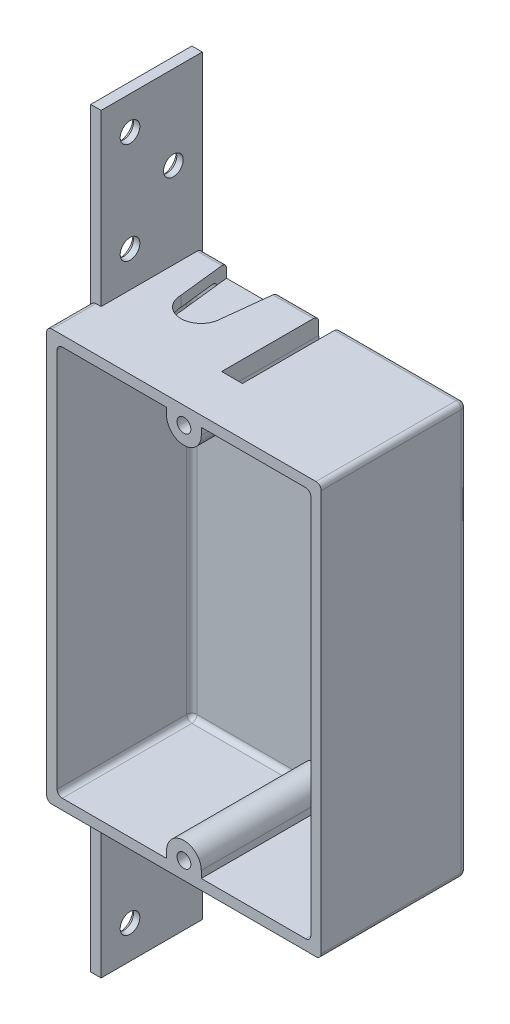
ISO-10303-21;
HEADER;
FILE_DESCRIPTION(('STEP AP214'),'2;1');
FILE_NAME('part.step','',(''),(''),'','','');
FILE_SCHEMA(('AUTOMOTIVE_DESIGN { 1 0 10303 214 1 1 1 1 }'));
ENDSEC;
DATA;
#1=APPLICATION_CONTEXT('core data for automotive mechanical design processes');
#2=APPLICATION_PROTOCOL_DEFINITION('international standard','automotive_design',2000,#1);
#3=PRODUCT_CONTEXT('',#1,'mechanical');
#4=PRODUCT('Part','Part','',(#3));
#5=PRODUCT_RELATED_PRODUCT_CATEGORY('part','',(#4));
#6=PRODUCT_DEFINITION_FORMATION('','',#4);
#7=PRODUCT_DEFINITION_CONTEXT('part definition',#1,'design');
#8=PRODUCT_DEFINITION('design','',#6,#7);
#9=PRODUCT_DEFINITION_SHAPE('','',#8);
#10=(LENGTH_UNIT() NAMED_UNIT(*) SI_UNIT(.MILLI.,.METRE.));
#11=(NAMED_UNIT(*) PLANE_ANGLE_UNIT() SI_UNIT($,.RADIAN.));
#12=(NAMED_UNIT(*) SI_UNIT($,.STERADIAN.) SOLID_ANGLE_UNIT());
#13=UNCERTAINTY_MEASURE_WITH_UNIT(LENGTH_MEASURE(1.E-05),#10,'distance_accuracy_value','');
#14=(GEOMETRIC_REPRESENTATION_CONTEXT(3) GLOBAL_UNCERTAINTY_ASSIGNED_CONTEXT((#13)) GLOBAL_UNIT_ASSIGNED_CONTEXT((#10,
#11,#12)) REPRESENTATION_CONTEXT('',''));
#15=CARTESIAN_POINT('',(0.,0.,0.));
#16=DIRECTION('',(0.,0.,1.));
#17=DIRECTION('',(1.,0.,0.));
#18=AXIS2_PLACEMENT_3D('',#15,#16,#17);
#19=CARTESIAN_POINT('',(0.,41.402,31.9024));
#20=DIRECTION('',(0.,0.,-1.));
#21=DIRECTION('',(-1.,0.,0.));
#22=AXIS2_PLACEMENT_3D('',#19,#20,#21);
#23=CYLINDRICAL_SURFACE('',#22,1.524);
#24=CARTESIAN_POINT('',(0.,41.402,31.9024));
#25=DIRECTION('',(0.,0.,-1.));
#26=DIRECTION('',(1.,0.,0.));
#27=AXIS2_PLACEMENT_3D('',#24,#25,#26);
#28=CIRCLE('',#27,1.524);
#29=CARTESIAN_POINT('',(1.524,41.402,31.9024));
#30=VERTEX_POINT('',#29);
#31=EDGE_CURVE('E486',#30,#30,#28,.T.);
#32=ORIENTED_EDGE('',*,*,#31,.F.);
#33=EDGE_LOOP('',(#32));
#34=FACE_BOUND('',#33,.T.);
#35=CARTESIAN_POINT('',(0.,41.402,21.336));
#36=DIRECTION('',(0.,0.,-1.));
#37=DIRECTION('',(-1.,0.,0.));
#38=AXIS2_PLACEMENT_3D('',#35,#36,#37);
#39=CIRCLE('',#38,1.524);
#40=CARTESIAN_POINT('',(-1.524,41.402,21.336));
#41=VERTEX_POINT('',#40);
#42=EDGE_CURVE('E481',#41,#41,#39,.F.);
#43=ORIENTED_EDGE('',*,*,#42,.F.);
#44=EDGE_LOOP('',(#43));
#45=FACE_BOUND('',#44,.T.);
#46=ADVANCED_FACE('F38',(#34,#45),#23,.F.);
#47=CARTESIAN_POINT('',(-30.1625,42.926,31.9024));
#48=DIRECTION('',(0.,-1.,0.));
#49=DIRECTION('',(0.,0.,-1.));
#50=AXIS2_PLACEMENT_3D('',#47,#48,#49);
#51=PLANE('',#50);
#52=DIRECTION('',(0.,0.,-1.));
#53=VECTOR('',#52,1.);
#54=CARTESIAN_POINT('',(-26.7335,42.926,2.286));
#55=LINE('',#54,#53);
#56=CARTESIAN_POINT('',(-26.7335,42.926,31.9024));
#57=VERTEX_POINT('',#56);
#58=CARTESIAN_POINT('',(-26.7335,42.926,3.429));
#59=VERTEX_POINT('',#58);
#60=EDGE_CURVE('E63',#57,#59,#55,.T.);
#61=ORIENTED_EDGE('',*,*,#60,.T.);
#62=DIRECTION('',(-1.,0.,0.));
#63=VECTOR('',#62,1.);
#64=CARTESIAN_POINT('',(-22.2856460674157,42.926,3.429));
#65=LINE('',#64,#63);
#66=CARTESIAN_POINT('',(-22.1572191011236,42.926,3.429));
#67=VERTEX_POINT('',#66);
#68=EDGE_CURVE('E956',#59,#67,#65,.F.);
#69=ORIENTED_EDGE('',*,*,#68,.T.);
#70=DIRECTION('',(0.111656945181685,0.,0.993746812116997));
#71=VECTOR('',#70,1.);
#72=CARTESIAN_POINT('',(-22.5425,42.926,0.));
#73=LINE('',#72,#71);
#74=CARTESIAN_POINT('',(-21.2725,42.926,11.303));
#75=VERTEX_POINT('',#74);
#76=EDGE_CURVE('E554',#67,#75,#73,.T.);
#77=ORIENTED_EDGE('',*,*,#76,.T.);
#78=CARTESIAN_POINT('',(-16.8275,42.926,11.303));
#79=DIRECTION('',(0.,-1.,0.));
#80=DIRECTION('',(0.,0.,-1.));
#81=AXIS2_PLACEMENT_3D('',#78,#79,#80);
#82=CIRCLE('',#81,4.445);
#83=CARTESIAN_POINT('',(-12.3825,42.926,11.303));
#84=VERTEX_POINT('',#83);
#85=EDGE_CURVE('E551',#75,#84,#82,.F.);
#86=ORIENTED_EDGE('',*,*,#85,.T.);
#87=DIRECTION('',(0.111656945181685,0.,-0.993746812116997));
#88=VECTOR('',#87,1.);
#89=CARTESIAN_POINT('',(-11.1125,42.926,0.));
#90=LINE('',#89,#88);
#91=CARTESIAN_POINT('',(-11.3693539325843,42.926,2.286));
#92=VERTEX_POINT('',#91);
#93=EDGE_CURVE('E566',#84,#92,#90,.T.);
#94=ORIENTED_EDGE('',*,*,#93,.T.);
#95=DIRECTION('',(-1.,0.,0.));
#96=VECTOR('',#95,1.);
#97=CARTESIAN_POINT('',(-30.1625,42.926,2.286));
#98=LINE('',#97,#96);
#99=CARTESIAN_POINT('',(-3.81,42.926,2.286));
#100=VERTEX_POINT('',#99);
#101=EDGE_CURVE('E701',#100,#92,#98,.T.);
#102=ORIENTED_EDGE('',*,*,#101,.F.);
#103=DIRECTION('',(0.,0.,-1.));
#104=VECTOR('',#103,1.);
#105=CARTESIAN_POINT('',(-3.81,42.926,31.9024));
#106=LINE('',#105,#104);
#107=CARTESIAN_POINT('',(-3.81,42.926,31.9024));
#108=VERTEX_POINT('',#107);
#109=EDGE_CURVE('E842',#108,#100,#106,.T.);
#110=ORIENTED_EDGE('',*,*,#109,.F.);
#111=DIRECTION('',(-1.,0.,0.));
#112=VECTOR('',#111,1.);
#113=CARTESIAN_POINT('',(-30.1625,42.926,31.9024));
#114=LINE('',#113,#112);
#115=EDGE_CURVE('E714',#108,#57,#114,.T.);
#116=ORIENTED_EDGE('',*,*,#115,.T.);
#117=EDGE_LOOP('',(#61,#69,#77,#86,#94,#102,#110,#116));
#118=FACE_BOUND('',#117,.T.);
#119=ADVANCED_FACE('F1051',(#118),#51,.T.);
#120=CARTESIAN_POINT('',(0.,0.,2.286));
#121=DIRECTION('',(0.,0.,1.));
#122=DIRECTION('',(1.,0.,0.));
#123=AXIS2_PLACEMENT_3D('',#120,#121,#122);
#124=PLANE('',#123);
#125=DIRECTION('',(1.,0.,0.));
#126=VECTOR('',#125,1.);
#127=CARTESIAN_POINT('',(-30.1625,-42.926,2.286));
#128=LINE('',#127,#126);
#129=CARTESIAN_POINT('',(22.2856460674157,-42.926,2.286));
#130=VERTEX_POINT('',#129);
#131=CARTESIAN_POINT('',(26.7335,-42.926,2.286));
#132=VERTEX_POINT('',#131);
#133=EDGE_CURVE('E698',#130,#132,#128,.T.);
#134=ORIENTED_EDGE('',*,*,#133,.T.);
#135=DIRECTION('',(0.,1.,0.));
#136=VECTOR('',#135,1.);
#137=CARTESIAN_POINT('',(26.7335,42.926,2.286));
#138=LINE('',#137,#136);
#139=CARTESIAN_POINT('',(26.7335,42.926,2.286));
#140=VERTEX_POINT('',#139);
#141=EDGE_CURVE('E930',#132,#140,#138,.T.);
#142=ORIENTED_EDGE('',*,*,#141,.T.);
#143=CARTESIAN_POINT('',(3.81,42.926,2.286));
#144=VERTEX_POINT('',#143);
#145=EDGE_CURVE('E702',#140,#144,#98,.T.);
#146=ORIENTED_EDGE('',*,*,#145,.T.);
#147=DIRECTION('',(0.,1.,0.));
#148=VECTOR('',#147,1.);
#149=CARTESIAN_POINT('',(3.80999999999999,0.,2.286));
#150=LINE('',#149,#148);
#151=CARTESIAN_POINT('',(3.81,41.402,2.286));
#152=VERTEX_POINT('',#151);
#153=EDGE_CURVE('E503',#152,#144,#150,.T.);
#154=ORIENTED_EDGE('',*,*,#153,.F.);
#155=CARTESIAN_POINT('',(0.,41.402,2.286));
#156=DIRECTION('',(0.,0.,1.));
#157=DIRECTION('',(1.,0.,0.));
#158=AXIS2_PLACEMENT_3D('',#155,#156,#157);
#159=CIRCLE('',#158,3.81);
#160=CARTESIAN_POINT('',(-3.81,41.402,2.286));
#161=VERTEX_POINT('',#160);
#162=EDGE_CURVE('E509',#161,#152,#159,.T.);
#163=ORIENTED_EDGE('',*,*,#162,.F.);
#164=DIRECTION('',(0.,-1.,0.));
#165=VECTOR('',#164,1.);
#166=CARTESIAN_POINT('',(-3.81000000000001,0.,2.286));
#167=LINE('',#166,#165);
#168=EDGE_CURVE('E506',#100,#161,#167,.T.);
#169=ORIENTED_EDGE('',*,*,#168,.F.);
#170=ORIENTED_EDGE('',*,*,#101,.T.);
#171=DIRECTION('',(0.,-1.,0.));
#172=VECTOR('',#171,1.);
#173=CARTESIAN_POINT('',(-11.3693539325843,82.551,2.286));
#174=LINE('',#173,#172);
#175=CARTESIAN_POINT('',(-11.3693539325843,42.164,2.286));
#176=VERTEX_POINT('',#175);
#177=EDGE_CURVE('E540',#92,#176,#174,.T.);
#178=ORIENTED_EDGE('',*,*,#177,.T.);
#179=DIRECTION('',(0.,-1.,0.));
#180=VECTOR('',#179,1.);
#181=CARTESIAN_POINT('',(-11.3693539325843,0.,2.286));
#182=LINE('',#181,#180);
#183=CARTESIAN_POINT('',(-11.3693539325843,40.259,2.286));
#184=VERTEX_POINT('',#183);
#185=EDGE_CURVE('E532',#176,#184,#182,.T.);
#186=ORIENTED_EDGE('',*,*,#185,.T.);
#187=DIRECTION('',(1.,0.,0.));
#188=VECTOR('',#187,1.);
#189=CARTESIAN_POINT('',(0.,40.259,2.286));
#190=LINE('',#189,#188);
#191=CARTESIAN_POINT('',(-22.2856460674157,40.259,2.286));
#192=VERTEX_POINT('',#191);
#193=EDGE_CURVE('E537',#192,#184,#190,.T.);
#194=ORIENTED_EDGE('',*,*,#193,.F.);
#195=DIRECTION('',(0.,1.,0.));
#196=VECTOR('',#195,1.);
#197=CARTESIAN_POINT('',(-22.2856460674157,0.,2.286));
#198=LINE('',#197,#196);
#199=CARTESIAN_POINT('',(-22.2856460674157,41.783,2.286));
#200=VERTEX_POINT('',#199);
#201=EDGE_CURVE('E534',#192,#200,#198,.T.);
#202=ORIENTED_EDGE('',*,*,#201,.T.);
#203=DIRECTION('',(-1.,0.,0.));
#204=VECTOR('',#203,1.);
#205=CARTESIAN_POINT('',(-27.8765,41.783,2.286));
#206=LINE('',#205,#204);
#207=CARTESIAN_POINT('',(-26.7335,41.783,2.286));
#208=VERTEX_POINT('',#207);
#209=EDGE_CURVE('E923',#200,#208,#206,.T.);
#210=ORIENTED_EDGE('',*,*,#209,.T.);
#211=DIRECTION('',(0.,-1.,0.));
#212=VECTOR('',#211,1.);
#213=CARTESIAN_POINT('',(-26.7335,-42.926,2.286));
#214=LINE('',#213,#212);
#215=CARTESIAN_POINT('',(-26.7335,-41.783,2.286));
#216=VERTEX_POINT('',#215);
#217=EDGE_CURVE('E925',#208,#216,#214,.T.);
#218=ORIENTED_EDGE('',*,*,#217,.T.);
#219=DIRECTION('',(1.,0.,0.));
#220=VECTOR('',#219,1.);
#221=CARTESIAN_POINT('',(-3.81,-41.783,2.286));
#222=LINE('',#221,#220);
#223=CARTESIAN_POINT('',(-3.81,-41.783,2.286));
#224=VERTEX_POINT('',#223);
#225=EDGE_CURVE('E927',#216,#224,#222,.T.);
#226=ORIENTED_EDGE('',*,*,#225,.T.);
#227=DIRECTION('',(0.,-1.,0.));
#228=VECTOR('',#227,1.);
#229=CARTESIAN_POINT('',(-3.80999999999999,0.,2.286));
#230=LINE('',#229,#228);
#231=CARTESIAN_POINT('',(-3.81,-41.402,2.286));
#232=VERTEX_POINT('',#231);
#233=EDGE_CURVE('E623',#232,#224,#230,.T.);
#234=ORIENTED_EDGE('',*,*,#233,.F.);
#235=CARTESIAN_POINT('',(0.,-41.402,2.286));
#236=DIRECTION('',(0.,0.,1.));
#237=DIRECTION('',(1.,0.,0.));
#238=AXIS2_PLACEMENT_3D('',#235,#236,#237);
#239=CIRCLE('',#238,3.81);
#240=CARTESIAN_POINT('',(3.81,-41.402,2.286));
#241=VERTEX_POINT('',#240);
#242=EDGE_CURVE('E629',#241,#232,#239,.T.);
#243=ORIENTED_EDGE('',*,*,#242,.F.);
#244=DIRECTION('',(0.,1.,0.));
#245=VECTOR('',#244,1.);
#246=CARTESIAN_POINT('',(3.81000000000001,0.,2.286));
#247=LINE('',#246,#245);
#248=CARTESIAN_POINT('',(3.81,-42.926,2.286));
#249=VERTEX_POINT('',#248);
#250=EDGE_CURVE('E626',#249,#241,#247,.T.);
#251=ORIENTED_EDGE('',*,*,#250,.F.);
#252=CARTESIAN_POINT('',(11.3693539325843,-42.926,2.286));
#253=VERTEX_POINT('',#252);
#254=EDGE_CURVE('E699',#249,#253,#128,.T.);
#255=ORIENTED_EDGE('',*,*,#254,.T.);
#256=DIRECTION('',(0.,1.,0.));
#257=VECTOR('',#256,1.);
#258=CARTESIAN_POINT('',(11.3693539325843,-82.551,2.286));
#259=LINE('',#258,#257);
#260=CARTESIAN_POINT('',(11.3693539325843,-42.164,2.286));
#261=VERTEX_POINT('',#260);
#262=EDGE_CURVE('E657',#253,#261,#259,.T.);
#263=ORIENTED_EDGE('',*,*,#262,.T.);
#264=DIRECTION('',(0.,1.,0.));
#265=VECTOR('',#264,1.);
#266=CARTESIAN_POINT('',(11.3693539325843,0.,2.286));
#267=LINE('',#266,#265);
#268=CARTESIAN_POINT('',(11.3693539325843,-40.259,2.286));
#269=VERTEX_POINT('',#268);
#270=EDGE_CURVE('E652',#261,#269,#267,.T.);
#271=ORIENTED_EDGE('',*,*,#270,.T.);
#272=DIRECTION('',(-1.,0.,0.));
#273=VECTOR('',#272,1.);
#274=CARTESIAN_POINT('',(0.,-40.259,2.286));
#275=LINE('',#274,#273);
#276=CARTESIAN_POINT('',(22.2856460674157,-40.259,2.286));
#277=VERTEX_POINT('',#276);
#278=EDGE_CURVE('E817',#277,#269,#275,.T.);
#279=ORIENTED_EDGE('',*,*,#278,.F.);
#280=DIRECTION('',(0.,-1.,0.));
#281=VECTOR('',#280,1.);
#282=CARTESIAN_POINT('',(22.2856460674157,0.,2.286));
#283=LINE('',#282,#281);
#284=CARTESIAN_POINT('',(22.2856460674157,-42.164,2.286));
#285=VERTEX_POINT('',#284);
#286=EDGE_CURVE('E654',#277,#285,#283,.T.);
#287=ORIENTED_EDGE('',*,*,#286,.T.);
#288=DIRECTION('',(0.,-1.,0.));
#289=VECTOR('',#288,1.);
#290=CARTESIAN_POINT('',(22.2856460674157,-82.551,2.286));
#291=LINE('',#290,#289);
#292=EDGE_CURVE('E660',#285,#130,#291,.T.);
#293=ORIENTED_EDGE('',*,*,#292,.T.);
#294=EDGE_LOOP('',(#134,#142,#146,#154,#163,#169,#170,#178,#186,#194,#202,#210,#218,#226,#234,
#243,#251,#255,#263,#271,#279,#287,#293));
#295=FACE_BOUND('',#294,.T.);
#296=ADVANCED_FACE('F1043',(#295),#124,.T.);
#297=CARTESIAN_POINT('',(0.,-41.402,31.9024));
#298=DIRECTION('',(0.,0.,-1.));
#299=DIRECTION('',(-1.,0.,0.));
#300=AXIS2_PLACEMENT_3D('',#297,#298,#299);
#301=CYLINDRICAL_SURFACE('',#300,1.524);
#302=CARTESIAN_POINT('',(0.,-41.402,31.9024));
#303=DIRECTION('',(0.,0.,-1.));
#304=DIRECTION('',(-1.,0.,0.));
#305=AXIS2_PLACEMENT_3D('',#302,#303,#304);
#306=CIRCLE('',#305,1.524);
#307=CARTESIAN_POINT('',(-1.524,-41.402,31.9024));
#308=VERTEX_POINT('',#307);
#309=EDGE_CURVE('E606',#308,#308,#306,.T.);
#310=ORIENTED_EDGE('',*,*,#309,.F.);
#311=EDGE_LOOP('',(#310));
#312=FACE_BOUND('',#311,.T.);
#313=CARTESIAN_POINT('',(0.,-41.402,21.336));
#314=DIRECTION('',(0.,0.,-1.));
#315=DIRECTION('',(-1.,0.,0.));
#316=AXIS2_PLACEMENT_3D('',#313,#314,#315);
#317=CIRCLE('',#316,1.524);
#318=CARTESIAN_POINT('',(-1.524,-41.402,21.336));
#319=VERTEX_POINT('',#318);
#320=EDGE_CURVE('E597',#319,#319,#317,.F.);
#321=ORIENTED_EDGE('',*,*,#320,.F.);
#322=EDGE_LOOP('',(#321));
#323=FACE_BOUND('',#322,.T.);
#324=ADVANCED_FACE('F1568',(#312,#323),#301,.F.);
#325=CARTESIAN_POINT('',(-30.1625,-42.926,31.9024));
#326=DIRECTION('',(0.,1.,0.));
#327=DIRECTION('',(0.,0.,1.));
#328=AXIS2_PLACEMENT_3D('',#325,#326,#327);
#329=PLANE('',#328);
#330=DIRECTION('',(1.,0.,0.));
#331=VECTOR('',#330,1.);
#332=CARTESIAN_POINT('',(-30.1625,-42.926,31.9024));
#333=LINE('',#332,#331);
#334=CARTESIAN_POINT('',(3.81,-42.926,31.9024));
#335=VERTEX_POINT('',#334);
#336=CARTESIAN_POINT('',(26.7335,-42.926,31.9024));
#337=VERTEX_POINT('',#336);
#338=EDGE_CURVE('E707',#335,#337,#333,.T.);
#339=ORIENTED_EDGE('',*,*,#338,.T.);
#340=DIRECTION('',(0.,0.,-1.));
#341=VECTOR('',#340,1.);
#342=CARTESIAN_POINT('',(26.7335,-42.926,2.286));
#343=LINE('',#342,#341);
#344=EDGE_CURVE('E944',#337,#132,#343,.T.);
#345=ORIENTED_EDGE('',*,*,#344,.T.);
#346=ORIENTED_EDGE('',*,*,#133,.F.);
#347=DIRECTION('',(-0.111656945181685,0.,0.993746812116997));
#348=VECTOR('',#347,1.);
#349=CARTESIAN_POINT('',(22.5425,-42.926,0.));
#350=LINE('',#349,#348);
#351=CARTESIAN_POINT('',(21.2725,-42.926,11.303));
#352=VERTEX_POINT('',#351);
#353=EDGE_CURVE('E674',#130,#352,#350,.T.);
#354=ORIENTED_EDGE('',*,*,#353,.T.);
#355=CARTESIAN_POINT('',(16.8275,-42.926,11.303));
#356=DIRECTION('',(0.,1.,0.));
#357=DIRECTION('',(0.,0.,1.));
#358=AXIS2_PLACEMENT_3D('',#355,#356,#357);
#359=CIRCLE('',#358,4.445);
#360=CARTESIAN_POINT('',(12.3825,-42.926,11.303));
#361=VERTEX_POINT('',#360);
#362=EDGE_CURVE('E671',#352,#361,#359,.F.);
#363=ORIENTED_EDGE('',*,*,#362,.T.);
#364=DIRECTION('',(-0.111656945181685,0.,-0.993746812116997));
#365=VECTOR('',#364,1.);
#366=CARTESIAN_POINT('',(11.1125,-42.926,0.));
#367=LINE('',#366,#365);
#368=EDGE_CURVE('E689',#361,#253,#367,.T.);
#369=ORIENTED_EDGE('',*,*,#368,.T.);
#370=ORIENTED_EDGE('',*,*,#254,.F.);
#371=DIRECTION('',(0.,0.,-1.));
#372=VECTOR('',#371,1.);
#373=CARTESIAN_POINT('',(3.81,-42.926,31.9024));
#374=LINE('',#373,#372);
#375=EDGE_CURVE('E834',#335,#249,#374,.T.);
#376=ORIENTED_EDGE('',*,*,#375,.F.);
#377=EDGE_LOOP('',(#339,#345,#346,#354,#363,#369,#370,#376));
#378=FACE_BOUND('',#377,.T.);
#379=ADVANCED_FACE('F1576',(#378),#329,.T.);
#380=CARTESIAN_POINT('',(-30.1625,45.212,31.9024));
#381=DIRECTION('',(1.,0.,0.));
#382=DIRECTION('',(0.,0.,-1.));
#383=AXIS2_PLACEMENT_3D('',#380,#381,#382);
#384=PLANE('',#383);
#385=CARTESIAN_POINT('',(-30.1625,75.2475,15.875));
#386=DIRECTION('',(-1.,0.,0.));
#387=DIRECTION('',(0.,0.,1.));
#388=AXIS2_PLACEMENT_3D('',#385,#386,#387);
#389=CIRCLE('',#388,2.92099999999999);
#390=CARTESIAN_POINT('',(-30.1625,75.2475,18.796));
#391=VERTEX_POINT('',#390);
#392=EDGE_CURVE('E717',#391,#391,#389,.T.);
#393=ORIENTED_EDGE('',*,*,#392,.F.);
#394=EDGE_LOOP('',(#393));
#395=FACE_BOUND('',#394,.T.);
#396=CARTESIAN_POINT('',(-30.1625,64.135,6.34999999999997));
#397=DIRECTION('',(-1.,0.,0.));
#398=DIRECTION('',(0.,0.,1.));
#399=AXIS2_PLACEMENT_3D('',#396,#397,#398);
#400=CIRCLE('',#399,2.92099999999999);
#401=CARTESIAN_POINT('',(-30.1625,64.135,9.27099999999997));
#402=VERTEX_POINT('',#401);
#403=EDGE_CURVE('E724',#402,#402,#400,.T.);
#404=ORIENTED_EDGE('',*,*,#403,.F.);
#405=EDGE_LOOP('',(#404));
#406=FACE_BOUND('',#405,.T.);
#407=CARTESIAN_POINT('',(-30.1625,53.0225,15.875));
#408=DIRECTION('',(-1.,0.,0.));
#409=DIRECTION('',(0.,0.,1.));
#410=AXIS2_PLACEMENT_3D('',#407,#408,#409);
#411=CIRCLE('',#410,2.921);
#412=CARTESIAN_POINT('',(-30.1625,53.0225,18.796));
#413=VERTEX_POINT('',#412);
#414=EDGE_CURVE('E731',#413,#413,#411,.T.);
#415=ORIENTED_EDGE('',*,*,#414,.F.);
#416=EDGE_LOOP('',(#415));
#417=FACE_BOUND('',#416,.T.);
#418=CARTESIAN_POINT('',(-30.1625,-53.0225,15.875));
#419=DIRECTION('',(-1.,0.,0.));
#420=DIRECTION('',(0.,0.,1.));
#421=AXIS2_PLACEMENT_3D('',#418,#419,#420);
#422=CIRCLE('',#421,2.921);
#423=CARTESIAN_POINT('',(-30.1625,-53.0225,18.796));
#424=VERTEX_POINT('',#423);
#425=EDGE_CURVE('E738',#424,#424,#422,.T.);
#426=ORIENTED_EDGE('',*,*,#425,.F.);
#427=EDGE_LOOP('',(#426));
#428=FACE_BOUND('',#427,.T.);
#429=CARTESIAN_POINT('',(-30.1625,-64.135,6.34999999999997));
#430=DIRECTION('',(-1.,0.,0.));
#431=DIRECTION('',(0.,0.,1.));
#432=AXIS2_PLACEMENT_3D('',#429,#430,#431);
#433=CIRCLE('',#432,2.921);
#434=CARTESIAN_POINT('',(-30.1625,-64.135,9.27099999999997));
#435=VERTEX_POINT('',#434);
#436=EDGE_CURVE('E745',#435,#435,#433,.T.);
#437=ORIENTED_EDGE('',*,*,#436,.F.);
#438=EDGE_LOOP('',(#437));
#439=FACE_BOUND('',#438,.T.);
#440=CARTESIAN_POINT('',(-30.1625,-75.2475,15.875));
#441=DIRECTION('',(-1.,0.,0.));
#442=DIRECTION('',(0.,0.,1.));
#443=AXIS2_PLACEMENT_3D('',#440,#441,#442);
#444=CIRCLE('',#443,2.92099999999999);
#445=CARTESIAN_POINT('',(-30.1625,-75.2475,18.796));
#446=VERTEX_POINT('',#445);
#447=EDGE_CURVE('E752',#446,#446,#444,.T.);
#448=ORIENTED_EDGE('',*,*,#447,.F.);
#449=EDGE_LOOP('',(#448));
#450=FACE_BOUND('',#449,.T.);
#451=DIRECTION('',(0.,1.,0.));
#452=VECTOR('',#451,1.);
#453=CARTESIAN_POINT('',(-30.1625,82.55,22.225));
#454=LINE('',#453,#452);
#455=CARTESIAN_POINT('',(-30.1625,-82.55,22.225));
#456=VERTEX_POINT('',#455);
#457=CARTESIAN_POINT('',(-30.1625,-44.069,22.225));
#458=VERTEX_POINT('',#457);
#459=EDGE_CURVE('E777',#456,#458,#454,.T.);
#460=ORIENTED_EDGE('',*,*,#459,.T.);
#461=DIRECTION('',(0.,0.,-1.));
#462=VECTOR('',#461,1.);
#463=CARTESIAN_POINT('',(-30.1625,-44.069,31.9024));
#464=LINE('',#463,#462);
#465=CARTESIAN_POINT('',(-30.1625,-44.069,31.9024));
#466=VERTEX_POINT('',#465);
#467=EDGE_CURVE('E921',#458,#466,#464,.F.);
#468=ORIENTED_EDGE('',*,*,#467,.T.);
#469=DIRECTION('',(0.,-1.,0.));
#470=VECTOR('',#469,1.);
#471=CARTESIAN_POINT('',(-30.1625,45.212,31.9024));
#472=LINE('',#471,#470);
#473=CARTESIAN_POINT('',(-30.1625,44.069,31.9024));
#474=VERTEX_POINT('',#473);
#475=EDGE_CURVE('E801',#474,#466,#472,.T.);
#476=ORIENTED_EDGE('',*,*,#475,.F.);
#477=DIRECTION('',(0.,0.,-1.));
#478=VECTOR('',#477,1.);
#479=CARTESIAN_POINT('',(-30.1625,44.069,31.9024));
#480=LINE('',#479,#478);
#481=CARTESIAN_POINT('',(-30.1625,44.069,22.225));
#482=VERTEX_POINT('',#481);
#483=EDGE_CURVE('E918',#474,#482,#480,.T.);
#484=ORIENTED_EDGE('',*,*,#483,.T.);
#485=CARTESIAN_POINT('',(-30.1625,82.55,22.225));
#486=VERTEX_POINT('',#485);
#487=EDGE_CURVE('E776',#482,#486,#454,.T.);
#488=ORIENTED_EDGE('',*,*,#487,.T.);
#489=DIRECTION('',(0.,0.,-1.));
#490=VECTOR('',#489,1.);
#491=CARTESIAN_POINT('',(-30.1625,82.55,0.));
#492=LINE('',#491,#490);
#493=CARTESIAN_POINT('',(-30.1625,82.55,0.));
#494=VERTEX_POINT('',#493);
#495=EDGE_CURVE('E779',#486,#494,#492,.T.);
#496=ORIENTED_EDGE('',*,*,#495,.T.);
#497=DIRECTION('',(0.,-1.,0.));
#498=VECTOR('',#497,1.);
#499=CARTESIAN_POINT('',(-30.1625,45.212,0.));
#500=LINE('',#499,#498);
#501=CARTESIAN_POINT('',(-30.1625,-82.55,0.));
#502=VERTEX_POINT('',#501);
#503=EDGE_CURVE('E800',#494,#502,#500,.T.);
#504=ORIENTED_EDGE('',*,*,#503,.T.);
#505=DIRECTION('',(0.,0.,1.));
#506=VECTOR('',#505,1.);
#507=CARTESIAN_POINT('',(-30.1625,-82.55,0.));
#508=LINE('',#507,#506);
#509=EDGE_CURVE('E773',#502,#456,#508,.T.);
#510=ORIENTED_EDGE('',*,*,#509,.T.);
#511=EDGE_LOOP('',(#460,#468,#476,#484,#488,#496,#504,#510));
#512=FACE_BOUND('',#511,.T.);
#513=ADVANCED_FACE('F1180',(#395,#406,#417,#428,#439,#450,#512),#384,.F.);
#514=CARTESIAN_POINT('',(-30.1625,-45.212,31.9024));
#515=DIRECTION('',(0.,1.,0.));
#516=DIRECTION('',(0.,0.,1.));
#517=AXIS2_PLACEMENT_3D('',#514,#515,#516);
#518=PLANE('',#517);
#519=DIRECTION('',(0.,0.,1.));
#520=VECTOR('',#519,1.);
#521=CARTESIAN_POINT('',(-27.8765,-45.212,31.9024));
#522=LINE('',#521,#520);
#523=CARTESIAN_POINT('',(-27.8765,-45.212,1.143));
#524=VERTEX_POINT('',#523);
#525=CARTESIAN_POINT('',(-27.8765,-45.212,22.225));
#526=VERTEX_POINT('',#525);
#527=EDGE_CURVE('E795',#524,#526,#522,.T.);
#528=ORIENTED_EDGE('',*,*,#527,.F.);
#529=DIRECTION('',(1.,0.,0.));
#530=VECTOR('',#529,1.);
#531=CARTESIAN_POINT('',(-30.1625,-45.212,1.143));
#532=LINE('',#531,#530);
#533=CARTESIAN_POINT('',(-2.286,-45.212,1.143));
#534=VERTEX_POINT('',#533);
#535=EDGE_CURVE('E891',#524,#534,#532,.T.);
#536=ORIENTED_EDGE('',*,*,#535,.T.);
#537=DIRECTION('',(0.,0.,-1.));
#538=VECTOR('',#537,1.);
#539=CARTESIAN_POINT('',(-2.286,-45.212,21.336));
#540=LINE('',#539,#538);
#541=CARTESIAN_POINT('',(-2.286,-45.212,21.336));
#542=VERTEX_POINT('',#541);
#543=EDGE_CURVE('E598',#542,#534,#540,.T.);
#544=ORIENTED_EDGE('',*,*,#543,.F.);
#545=DIRECTION('',(-1.,0.,0.));
#546=VECTOR('',#545,1.);
#547=CARTESIAN_POINT('',(2.286,-45.212,21.336));
#548=LINE('',#547,#546);
#549=CARTESIAN_POINT('',(2.286,-45.212,21.336));
#550=VERTEX_POINT('',#549);
#551=EDGE_CURVE('E583',#550,#542,#548,.T.);
#552=ORIENTED_EDGE('',*,*,#551,.F.);
#553=DIRECTION('',(0.,0.,-1.));
#554=VECTOR('',#553,1.);
#555=CARTESIAN_POINT('',(2.286,-45.212,21.336));
#556=LINE('',#555,#554);
#557=CARTESIAN_POINT('',(2.286,-45.212,1.143));
#558=VERTEX_POINT('',#557);
#559=EDGE_CURVE('E601',#550,#558,#556,.T.);
#560=ORIENTED_EDGE('',*,*,#559,.T.);
#561=DIRECTION('',(1.,0.,0.));
#562=VECTOR('',#561,1.);
#563=CARTESIAN_POINT('',(-30.1625,-45.212,1.143));
#564=LINE('',#563,#562);
#565=CARTESIAN_POINT('',(11.2409269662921,-45.212,1.143));
#566=VERTEX_POINT('',#565);
#567=EDGE_CURVE('E888',#558,#566,#564,.T.);
#568=ORIENTED_EDGE('',*,*,#567,.T.);
#569=DIRECTION('',(-0.111656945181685,0.,-0.993746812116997));
#570=VECTOR('',#569,1.);
#571=CARTESIAN_POINT('',(11.1125,-45.212,0.));
#572=LINE('',#571,#570);
#573=CARTESIAN_POINT('',(12.3825,-45.212,11.303));
#574=VERTEX_POINT('',#573);
#575=EDGE_CURVE('E663',#574,#566,#572,.T.);
#576=ORIENTED_EDGE('',*,*,#575,.F.);
#577=CARTESIAN_POINT('',(16.8275,-45.212,11.303));
#578=DIRECTION('',(0.,1.,0.));
#579=DIRECTION('',(0.,0.,1.));
#580=AXIS2_PLACEMENT_3D('',#577,#578,#579);
#581=CIRCLE('',#580,4.445);
#582=CARTESIAN_POINT('',(21.2725,-45.212,11.303));
#583=VERTEX_POINT('',#582);
#584=EDGE_CURVE('E666',#583,#574,#581,.F.);
#585=ORIENTED_EDGE('',*,*,#584,.F.);
#586=DIRECTION('',(-0.111656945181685,0.,0.993746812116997));
#587=VECTOR('',#586,1.);
#588=CARTESIAN_POINT('',(22.5425,-45.212,0.));
#589=LINE('',#588,#587);
#590=CARTESIAN_POINT('',(22.4140730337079,-45.212,1.143));
#591=VERTEX_POINT('',#590);
#592=EDGE_CURVE('E669',#591,#583,#589,.T.);
#593=ORIENTED_EDGE('',*,*,#592,.F.);
#594=DIRECTION('',(1.,0.,0.));
#595=VECTOR('',#594,1.);
#596=CARTESIAN_POINT('',(-30.1625,-45.212,1.143));
#597=LINE('',#596,#595);
#598=CARTESIAN_POINT('',(29.0195,-45.212,1.143));
#599=VERTEX_POINT('',#598);
#600=EDGE_CURVE('E886',#591,#599,#597,.T.);
#601=ORIENTED_EDGE('',*,*,#600,.T.);
#602=DIRECTION('',(0.,0.,-1.));
#603=VECTOR('',#602,1.);
#604=CARTESIAN_POINT('',(29.0195,-45.212,31.9024));
#605=LINE('',#604,#603);
#606=CARTESIAN_POINT('',(29.0195,-45.212,31.9024));
#607=VERTEX_POINT('',#606);
#608=EDGE_CURVE('E884',#599,#607,#605,.F.);
#609=ORIENTED_EDGE('',*,*,#608,.T.);
#610=DIRECTION('',(1.,0.,0.));
#611=VECTOR('',#610,1.);
#612=CARTESIAN_POINT('',(-30.1625,-45.212,31.9024));
#613=LINE('',#612,#611);
#614=CARTESIAN_POINT('',(-29.0195,-45.212,31.9024));
#615=VERTEX_POINT('',#614);
#616=EDGE_CURVE('E804',#615,#607,#613,.T.);
#617=ORIENTED_EDGE('',*,*,#616,.F.);
#618=DIRECTION('',(0.,0.,-1.));
#619=VECTOR('',#618,1.);
#620=CARTESIAN_POINT('',(-29.0195,-45.212,31.9024));
#621=LINE('',#620,#619);
#622=CARTESIAN_POINT('',(-29.0195,-45.212,22.225));
#623=VERTEX_POINT('',#622);
#624=EDGE_CURVE('E881',#615,#623,#621,.T.);
#625=ORIENTED_EDGE('',*,*,#624,.T.);
#626=DIRECTION('',(1.,0.,0.));
#627=VECTOR('',#626,1.);
#628=CARTESIAN_POINT('',(-30.1625,-45.212,22.225));
#629=LINE('',#628,#627);
#630=EDGE_CURVE('E797',#623,#526,#629,.T.);
#631=ORIENTED_EDGE('',*,*,#630,.T.);
#632=EDGE_LOOP('',(#528,#536,#544,#552,#560,#568,#576,#585,#593,#601,#609,#617,#625,#631));
#633=FACE_BOUND('',#632,.T.);
#634=ADVANCED_FACE('F1141',(#633),#518,.F.);
#635=CARTESIAN_POINT('',(30.1625,45.212,31.9024));
#636=DIRECTION('',(-1.,0.,0.));
#637=DIRECTION('',(0.,0.,1.));
#638=AXIS2_PLACEMENT_3D('',#635,#636,#637);
#639=PLANE('',#638);
#640=DIRECTION('',(0.,1.,0.));
#641=VECTOR('',#640,1.);
#642=CARTESIAN_POINT('',(30.1625,45.212,1.143));
#643=LINE('',#642,#641);
#644=CARTESIAN_POINT('',(30.1625,-44.069,1.143));
#645=VERTEX_POINT('',#644);
#646=CARTESIAN_POINT('',(30.1625,44.069,1.143));
#647=VERTEX_POINT('',#646);
#648=EDGE_CURVE('E902',#645,#647,#643,.T.);
#649=ORIENTED_EDGE('',*,*,#648,.T.);
#650=DIRECTION('',(0.,0.,-1.));
#651=VECTOR('',#650,1.);
#652=CARTESIAN_POINT('',(30.1625,44.069,31.9024));
#653=LINE('',#652,#651);
#654=CARTESIAN_POINT('',(30.1625,44.069,31.9024));
#655=VERTEX_POINT('',#654);
#656=EDGE_CURVE('E904',#647,#655,#653,.F.);
#657=ORIENTED_EDGE('',*,*,#656,.T.);
#658=DIRECTION('',(0.,1.,0.));
#659=VECTOR('',#658,1.);
#660=CARTESIAN_POINT('',(30.1625,45.212,31.9024));
#661=LINE('',#660,#659);
#662=CARTESIAN_POINT('',(30.1625,-44.069,31.9024));
#663=VERTEX_POINT('',#662);
#664=EDGE_CURVE('E807',#663,#655,#661,.T.);
#665=ORIENTED_EDGE('',*,*,#664,.F.);
#666=DIRECTION('',(0.,0.,-1.));
#667=VECTOR('',#666,1.);
#668=CARTESIAN_POINT('',(30.1625,-44.069,31.9024));
#669=LINE('',#668,#667);
#670=EDGE_CURVE('E900',#663,#645,#669,.T.);
#671=ORIENTED_EDGE('',*,*,#670,.T.);
#672=EDGE_LOOP('',(#649,#657,#665,#671));
#673=FACE_BOUND('',#672,.T.);
#674=ADVANCED_FACE('F1097',(#673),#639,.F.);
#675=CARTESIAN_POINT('',(-30.1625,45.212,31.9024));
#676=DIRECTION('',(0.,-1.,0.));
#677=DIRECTION('',(0.,0.,-1.));
#678=AXIS2_PLACEMENT_3D('',#675,#676,#677);
#679=PLANE('',#678);
#680=DIRECTION('',(0.111656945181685,0.,0.993746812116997));
#681=VECTOR('',#680,1.);
#682=CARTESIAN_POINT('',(-22.5425,45.212,0.));
#683=LINE('',#682,#681);
#684=CARTESIAN_POINT('',(-22.4140730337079,45.212,1.143));
#685=VERTEX_POINT('',#684);
#686=CARTESIAN_POINT('',(-21.2725,45.212,11.303));
#687=VERTEX_POINT('',#686);
#688=EDGE_CURVE('E549',#685,#687,#683,.T.);
#689=ORIENTED_EDGE('',*,*,#688,.F.);
#690=DIRECTION('',(-1.,0.,0.));
#691=VECTOR('',#690,1.);
#692=CARTESIAN_POINT('',(-30.1625,45.212,1.143));
#693=LINE('',#692,#691);
#694=CARTESIAN_POINT('',(-27.8765,45.212,1.143));
#695=VERTEX_POINT('',#694);
#696=EDGE_CURVE('E857',#685,#695,#693,.T.);
#697=ORIENTED_EDGE('',*,*,#696,.T.);
#698=DIRECTION('',(0.,0.,-1.));
#699=VECTOR('',#698,1.);
#700=CARTESIAN_POINT('',(-27.8765,45.212,31.9024));
#701=LINE('',#700,#699);
#702=CARTESIAN_POINT('',(-27.8765,45.212,22.225));
#703=VERTEX_POINT('',#702);
#704=EDGE_CURVE('E785',#703,#695,#701,.T.);
#705=ORIENTED_EDGE('',*,*,#704,.F.);
#706=DIRECTION('',(-1.,0.,0.));
#707=VECTOR('',#706,1.);
#708=CARTESIAN_POINT('',(-30.1625,45.212,22.225));
#709=LINE('',#708,#707);
#710=CARTESIAN_POINT('',(-29.0195,45.212,22.225));
#711=VERTEX_POINT('',#710);
#712=EDGE_CURVE('E813',#703,#711,#709,.T.);
#713=ORIENTED_EDGE('',*,*,#712,.T.);
#714=DIRECTION('',(0.,0.,-1.));
#715=VECTOR('',#714,1.);
#716=CARTESIAN_POINT('',(-29.0195,45.212,31.9024));
#717=LINE('',#716,#715);
#718=CARTESIAN_POINT('',(-29.0195,45.212,31.9024));
#719=VERTEX_POINT('',#718);
#720=EDGE_CURVE('E845',#711,#719,#717,.F.);
#721=ORIENTED_EDGE('',*,*,#720,.T.);
#722=DIRECTION('',(-1.,0.,0.));
#723=VECTOR('',#722,1.);
#724=CARTESIAN_POINT('',(-30.1625,45.212,31.9024));
#725=LINE('',#724,#723);
#726=CARTESIAN_POINT('',(29.0195,45.212,31.9024));
#727=VERTEX_POINT('',#726);
#728=EDGE_CURVE('E810',#727,#719,#725,.T.);
#729=ORIENTED_EDGE('',*,*,#728,.F.);
#730=DIRECTION('',(0.,0.,-1.));
#731=VECTOR('',#730,1.);
#732=CARTESIAN_POINT('',(29.0195,45.212,31.9024));
#733=LINE('',#732,#731);
#734=CARTESIAN_POINT('',(29.0195,45.212,1.143));
#735=VERTEX_POINT('',#734);
#736=EDGE_CURVE('E851',#727,#735,#733,.T.);
#737=ORIENTED_EDGE('',*,*,#736,.T.);
#738=DIRECTION('',(-1.,0.,0.));
#739=VECTOR('',#738,1.);
#740=CARTESIAN_POINT('',(-30.1625,45.212,1.143));
#741=LINE('',#740,#739);
#742=CARTESIAN_POINT('',(2.286,45.212,1.143));
#743=VERTEX_POINT('',#742);
#744=EDGE_CURVE('E849',#735,#743,#741,.T.);
#745=ORIENTED_EDGE('',*,*,#744,.T.);
#746=DIRECTION('',(0.,0.,-1.));
#747=VECTOR('',#746,1.);
#748=CARTESIAN_POINT('',(2.286,45.212,21.336));
#749=LINE('',#748,#747);
#750=CARTESIAN_POINT('',(2.286,45.212,21.336));
#751=VERTEX_POINT('',#750);
#752=EDGE_CURVE('E482',#751,#743,#749,.T.);
#753=ORIENTED_EDGE('',*,*,#752,.F.);
#754=DIRECTION('',(1.,0.,0.));
#755=VECTOR('',#754,1.);
#756=CARTESIAN_POINT('',(-2.286,45.212,21.336));
#757=LINE('',#756,#755);
#758=CARTESIAN_POINT('',(-2.286,45.212,21.336));
#759=VERTEX_POINT('',#758);
#760=EDGE_CURVE('E464',#759,#751,#757,.T.);
#761=ORIENTED_EDGE('',*,*,#760,.F.);
#762=DIRECTION('',(0.,0.,-1.));
#763=VECTOR('',#762,1.);
#764=CARTESIAN_POINT('',(-2.286,45.212,21.336));
#765=LINE('',#764,#763);
#766=CARTESIAN_POINT('',(-2.286,45.212,1.143));
#767=VERTEX_POINT('',#766);
#768=EDGE_CURVE('E455',#759,#767,#765,.T.);
#769=ORIENTED_EDGE('',*,*,#768,.T.);
#770=DIRECTION('',(-1.,0.,0.));
#771=VECTOR('',#770,1.);
#772=CARTESIAN_POINT('',(-30.1625,45.212,1.143));
#773=LINE('',#772,#771);
#774=CARTESIAN_POINT('',(-11.2409269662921,45.212,1.143));
#775=VERTEX_POINT('',#774);
#776=EDGE_CURVE('E854',#767,#775,#773,.T.);
#777=ORIENTED_EDGE('',*,*,#776,.T.);
#778=DIRECTION('',(0.111656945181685,0.,-0.993746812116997));
#779=VECTOR('',#778,1.);
#780=CARTESIAN_POINT('',(-11.1125,45.212,0.));
#781=LINE('',#780,#779);
#782=CARTESIAN_POINT('',(-12.3825,45.212,11.303));
#783=VERTEX_POINT('',#782);
#784=EDGE_CURVE('E543',#783,#775,#781,.T.);
#785=ORIENTED_EDGE('',*,*,#784,.F.);
#786=CARTESIAN_POINT('',(-16.8275,45.212,11.303));
#787=DIRECTION('',(0.,-1.,0.));
#788=DIRECTION('',(0.,0.,-1.));
#789=AXIS2_PLACEMENT_3D('',#786,#787,#788);
#790=CIRCLE('',#789,4.445);
#791=EDGE_CURVE('E546',#687,#783,#790,.F.);
#792=ORIENTED_EDGE('',*,*,#791,.F.);
#793=EDGE_LOOP('',(#689,#697,#705,#713,#721,#729,#737,#745,#753,#761,#769,#777,#785,#792));
#794=FACE_BOUND('',#793,.T.);
#795=ADVANCED_FACE('F1062',(#794),#679,.F.);
#796=CARTESIAN_POINT('',(0.,0.,31.9024));
#797=DIRECTION('',(0.,0.,1.));
#798=DIRECTION('',(1.,0.,0.));
#799=AXIS2_PLACEMENT_3D('',#796,#797,#798);
#800=PLANE('',#799);
#801=ORIENTED_EDGE('',*,*,#31,.T.);
#802=EDGE_LOOP('',(#801));
#803=FACE_BOUND('',#802,.T.);
#804=ORIENTED_EDGE('',*,*,#115,.F.);
#805=DIRECTION('',(0.,1.,0.));
#806=VECTOR('',#805,1.);
#807=CARTESIAN_POINT('',(-3.81,41.402,31.9024));
#808=LINE('',#807,#806);
#809=CARTESIAN_POINT('',(-3.81,41.402,31.9024));
#810=VERTEX_POINT('',#809);
#811=EDGE_CURVE('E489',#810,#108,#808,.T.);
#812=ORIENTED_EDGE('',*,*,#811,.F.);
#813=CARTESIAN_POINT('',(0.,41.402,31.9024));
#814=DIRECTION('',(0.,0.,1.));
#815=DIRECTION('',(1.,0.,0.));
#816=AXIS2_PLACEMENT_3D('',#813,#814,#815);
#817=CIRCLE('',#816,3.81);
#818=CARTESIAN_POINT('',(3.81,41.402,31.9024));
#819=VERTEX_POINT('',#818);
#820=EDGE_CURVE('E493',#819,#810,#817,.F.);
#821=ORIENTED_EDGE('',*,*,#820,.F.);
#822=DIRECTION('',(0.,-1.,0.));
#823=VECTOR('',#822,1.);
#824=CARTESIAN_POINT('',(3.81,41.402,31.9024));
#825=LINE('',#824,#823);
#826=CARTESIAN_POINT('',(3.81,42.926,31.9024));
#827=VERTEX_POINT('',#826);
#828=EDGE_CURVE('E492',#827,#819,#825,.T.);
#829=ORIENTED_EDGE('',*,*,#828,.F.);
#830=CARTESIAN_POINT('',(26.7335,42.926,31.9024));
#831=VERTEX_POINT('',#830);
#832=EDGE_CURVE('E715',#831,#827,#114,.T.);
#833=ORIENTED_EDGE('',*,*,#832,.F.);
#834=CARTESIAN_POINT('',(26.7335,41.783,31.9024));
#835=DIRECTION('',(0.,0.,1.));
#836=DIRECTION('',(1.,0.,0.));
#837=AXIS2_PLACEMENT_3D('',#834,#835,#836);
#838=CIRCLE('',#837,1.143);
#839=CARTESIAN_POINT('',(27.8765,41.783,31.9024));
#840=VERTEX_POINT('',#839);
#841=EDGE_CURVE('E972',#831,#840,#838,.F.);
#842=ORIENTED_EDGE('',*,*,#841,.T.);
#843=DIRECTION('',(0.,1.,0.));
#844=VECTOR('',#843,1.);
#845=CARTESIAN_POINT('',(27.8765,45.212,31.9024));
#846=LINE('',#845,#844);
#847=CARTESIAN_POINT('',(27.8765,-41.783,31.9024));
#848=VERTEX_POINT('',#847);
#849=EDGE_CURVE('E711',#848,#840,#846,.T.);
#850=ORIENTED_EDGE('',*,*,#849,.F.);
#851=CARTESIAN_POINT('',(26.7335,-41.783,31.9024));
#852=DIRECTION('',(0.,0.,1.));
#853=DIRECTION('',(1.,0.,0.));
#854=AXIS2_PLACEMENT_3D('',#851,#852,#853);
#855=CIRCLE('',#854,1.143);
#856=EDGE_CURVE('E970',#848,#337,#855,.F.);
#857=ORIENTED_EDGE('',*,*,#856,.T.);
#858=ORIENTED_EDGE('',*,*,#338,.F.);
#859=DIRECTION('',(0.,-1.,0.));
#860=VECTOR('',#859,1.);
#861=CARTESIAN_POINT('',(3.81,-41.402,31.9024));
#862=LINE('',#861,#860);
#863=CARTESIAN_POINT('',(3.81,-41.402,31.9024));
#864=VERTEX_POINT('',#863);
#865=EDGE_CURVE('E609',#864,#335,#862,.T.);
#866=ORIENTED_EDGE('',*,*,#865,.F.);
#867=CARTESIAN_POINT('',(0.,-41.402,31.9024));
#868=DIRECTION('',(0.,0.,1.));
#869=DIRECTION('',(1.,0.,0.));
#870=AXIS2_PLACEMENT_3D('',#867,#868,#869);
#871=CIRCLE('',#870,3.81);
#872=CARTESIAN_POINT('',(-3.81,-41.402,31.9024));
#873=VERTEX_POINT('',#872);
#874=EDGE_CURVE('E613',#873,#864,#871,.F.);
#875=ORIENTED_EDGE('',*,*,#874,.F.);
#876=DIRECTION('',(0.,1.,0.));
#877=VECTOR('',#876,1.);
#878=CARTESIAN_POINT('',(-3.81,-41.402,31.9024));
#879=LINE('',#878,#877);
#880=CARTESIAN_POINT('',(-3.81,-42.926,31.9024));
#881=VERTEX_POINT('',#880);
#882=EDGE_CURVE('E612',#881,#873,#879,.T.);
#883=ORIENTED_EDGE('',*,*,#882,.F.);
#884=CARTESIAN_POINT('',(-26.7335,-42.926,31.9024));
#885=VERTEX_POINT('',#884);
#886=EDGE_CURVE('E708',#885,#881,#333,.T.);
#887=ORIENTED_EDGE('',*,*,#886,.F.);
#888=CARTESIAN_POINT('',(-26.7335,-41.783,31.9024));
#889=DIRECTION('',(0.,0.,1.));
#890=DIRECTION('',(1.,0.,0.));
#891=AXIS2_PLACEMENT_3D('',#888,#889,#890);
#892=CIRCLE('',#891,1.143);
#893=CARTESIAN_POINT('',(-27.8765,-41.783,31.9024));
#894=VERTEX_POINT('',#893);
#895=EDGE_CURVE('E968',#885,#894,#892,.F.);
#896=ORIENTED_EDGE('',*,*,#895,.T.);
#897=DIRECTION('',(0.,-1.,0.));
#898=VECTOR('',#897,1.);
#899=CARTESIAN_POINT('',(-27.8765,45.212,31.9024));
#900=LINE('',#899,#898);
#901=CARTESIAN_POINT('',(-27.8765,41.783,31.9024));
#902=VERTEX_POINT('',#901);
#903=EDGE_CURVE('E704',#902,#894,#900,.T.);
#904=ORIENTED_EDGE('',*,*,#903,.F.);
#905=CARTESIAN_POINT('',(-26.7335,41.783,31.9024));
#906=DIRECTION('',(0.,0.,1.));
#907=DIRECTION('',(1.,0.,0.));
#908=AXIS2_PLACEMENT_3D('',#905,#906,#907);
#909=CIRCLE('',#908,1.143);
#910=EDGE_CURVE('E47',#902,#57,#909,.F.);
#911=ORIENTED_EDGE('',*,*,#910,.T.);
#912=EDGE_LOOP('',(#804,#812,#821,#829,#833,#842,#850,#857,#858,#866,#875,#883,#887,#896,#904,#911));
#913=FACE_BOUND('',#912,.T.);
#914=ORIENTED_EDGE('',*,*,#664,.T.);
#915=CARTESIAN_POINT('',(29.0195,44.069,31.9024));
#916=DIRECTION('',(0.,0.,1.));
#917=DIRECTION('',(1.,0.,0.));
#918=AXIS2_PLACEMENT_3D('',#915,#916,#917);
#919=CIRCLE('',#918,1.143);
#920=EDGE_CURVE('E912',#655,#727,#919,.T.);
#921=ORIENTED_EDGE('',*,*,#920,.T.);
#922=ORIENTED_EDGE('',*,*,#728,.T.);
#923=CARTESIAN_POINT('',(-29.0195,44.069,31.9024));
#924=DIRECTION('',(0.,0.,1.));
#925=DIRECTION('',(1.,0.,0.));
#926=AXIS2_PLACEMENT_3D('',#923,#924,#925);
#927=CIRCLE('',#926,1.143);
#928=EDGE_CURVE('E906',#719,#474,#927,.T.);
#929=ORIENTED_EDGE('',*,*,#928,.T.);
#930=ORIENTED_EDGE('',*,*,#475,.T.);
#931=CARTESIAN_POINT('',(-29.0195,-44.069,31.9024));
#932=DIRECTION('',(0.,0.,1.));
#933=DIRECTION('',(1.,0.,0.));
#934=AXIS2_PLACEMENT_3D('',#931,#932,#933);
#935=CIRCLE('',#934,1.143);
#936=EDGE_CURVE('E908',#466,#615,#935,.T.);
#937=ORIENTED_EDGE('',*,*,#936,.T.);
#938=ORIENTED_EDGE('',*,*,#616,.T.);
#939=CARTESIAN_POINT('',(29.0195,-44.069,31.9024));
#940=DIRECTION('',(0.,0.,1.));
#941=DIRECTION('',(1.,0.,0.));
#942=AXIS2_PLACEMENT_3D('',#939,#940,#941);
#943=CIRCLE('',#942,1.143);
#944=EDGE_CURVE('E910',#607,#663,#943,.T.);
#945=ORIENTED_EDGE('',*,*,#944,.T.);
#946=EDGE_LOOP('',(#914,#921,#922,#929,#930,#937,#938,#945));
#947=FACE_BOUND('',#946,.T.);
#948=ORIENTED_EDGE('',*,*,#309,.T.);
#949=EDGE_LOOP('',(#948));
#950=FACE_BOUND('',#949,.T.);
#951=ADVANCED_FACE('F1034',(#803,#913,#947,#950),#800,.T.);
#952=CARTESIAN_POINT('',(0.,0.,0.));
#953=DIRECTION('',(0.,0.,1.));
#954=DIRECTION('',(1.,0.,0.));
#955=AXIS2_PLACEMENT_3D('',#952,#953,#954);
#956=PLANE('',#955);
#957=DIRECTION('',(0.,-1.,0.));
#958=VECTOR('',#957,1.);
#959=CARTESIAN_POINT('',(-27.8765,82.55,0.));
#960=LINE('',#959,#958);
#961=CARTESIAN_POINT('',(-27.8765,82.55,0.));
#962=VERTEX_POINT('',#961);
#963=CARTESIAN_POINT('',(-27.8765,44.069,0.));
#964=VERTEX_POINT('',#963);
#965=EDGE_CURVE('E759',#962,#964,#960,.T.);
#966=ORIENTED_EDGE('',*,*,#965,.T.);
#967=DIRECTION('',(-1.,0.,0.));
#968=VECTOR('',#967,1.);
#969=CARTESIAN_POINT('',(0.,44.069,0.));
#970=LINE('',#969,#968);
#971=CARTESIAN_POINT('',(-22.5425,44.069,0.));
#972=VERTEX_POINT('',#971);
#973=EDGE_CURVE('E873',#964,#972,#970,.F.);
#974=ORIENTED_EDGE('',*,*,#973,.T.);
#975=DIRECTION('',(0.,-1.,0.));
#976=VECTOR('',#975,1.);
#977=CARTESIAN_POINT('',(-22.5425,82.551,0.));
#978=LINE('',#977,#976);
#979=CARTESIAN_POINT('',(-22.5425,42.164,0.));
#980=VERTEX_POINT('',#979);
#981=EDGE_CURVE('E562',#972,#980,#978,.T.);
#982=ORIENTED_EDGE('',*,*,#981,.T.);
#983=DIRECTION('',(1.,0.,0.));
#984=VECTOR('',#983,1.);
#985=CARTESIAN_POINT('',(-22.5425,42.164,0.));
#986=LINE('',#985,#984);
#987=CARTESIAN_POINT('',(-11.1125,42.164,0.));
#988=VERTEX_POINT('',#987);
#989=EDGE_CURVE('E557',#980,#988,#986,.T.);
#990=ORIENTED_EDGE('',*,*,#989,.T.);
#991=DIRECTION('',(0.,-1.,0.));
#992=VECTOR('',#991,1.);
#993=CARTESIAN_POINT('',(-11.1125,82.551,0.));
#994=LINE('',#993,#992);
#995=CARTESIAN_POINT('',(-11.1125,44.069,0.));
#996=VERTEX_POINT('',#995);
#997=EDGE_CURVE('E570',#996,#988,#994,.T.);
#998=ORIENTED_EDGE('',*,*,#997,.F.);
#999=DIRECTION('',(-1.,0.,0.));
#1000=VECTOR('',#999,1.);
#1001=CARTESIAN_POINT('',(0.,44.069,0.));
#1002=LINE('',#1001,#1000);
#1003=CARTESIAN_POINT('',(-2.286,44.069,0.));
#1004=VERTEX_POINT('',#1003);
#1005=EDGE_CURVE('E871',#996,#1004,#1002,.F.);
#1006=ORIENTED_EDGE('',*,*,#1005,.T.);
#1007=DIRECTION('',(0.,1.,0.));
#1008=VECTOR('',#1007,1.);
#1009=CARTESIAN_POINT('',(-2.286,41.402,0.));
#1010=LINE('',#1009,#1008);
#1011=CARTESIAN_POINT('',(-2.286,41.402,0.));
#1012=VERTEX_POINT('',#1011);
#1013=EDGE_CURVE('E471',#1012,#1004,#1010,.T.);
#1014=ORIENTED_EDGE('',*,*,#1013,.F.);
#1015=CARTESIAN_POINT('',(0.,41.402,0.));
#1016=DIRECTION('',(0.,0.,-1.));
#1017=DIRECTION('',(1.,0.,0.));
#1018=AXIS2_PLACEMENT_3D('',#1015,#1016,#1017);
#1019=CIRCLE('',#1018,2.286);
#1020=CARTESIAN_POINT('',(2.286,41.402,0.));
#1021=VERTEX_POINT('',#1020);
#1022=EDGE_CURVE('E451',#1021,#1012,#1019,.T.);
#1023=ORIENTED_EDGE('',*,*,#1022,.F.);
#1024=DIRECTION('',(0.,-1.,0.));
#1025=VECTOR('',#1024,1.);
#1026=CARTESIAN_POINT('',(2.286,45.212,0.));
#1027=LINE('',#1026,#1025);
#1028=CARTESIAN_POINT('',(2.286,44.069,0.));
#1029=VERTEX_POINT('',#1028);
#1030=EDGE_CURVE('E469',#1029,#1021,#1027,.T.);
#1031=ORIENTED_EDGE('',*,*,#1030,.F.);
#1032=DIRECTION('',(-1.,0.,0.));
#1033=VECTOR('',#1032,1.);
#1034=CARTESIAN_POINT('',(0.,44.069,0.));
#1035=LINE('',#1034,#1033);
#1036=CARTESIAN_POINT('',(29.0195,44.069,0.));
#1037=VERTEX_POINT('',#1036);
#1038=EDGE_CURVE('E864',#1029,#1037,#1035,.F.);
#1039=ORIENTED_EDGE('',*,*,#1038,.T.);
#1040=DIRECTION('',(0.,1.,0.));
#1041=VECTOR('',#1040,1.);
#1042=CARTESIAN_POINT('',(29.0195,0.,0.));
#1043=LINE('',#1042,#1041);
#1044=CARTESIAN_POINT('',(29.0195,-44.069,0.));
#1045=VERTEX_POINT('',#1044);
#1046=EDGE_CURVE('E862',#1037,#1045,#1043,.F.);
#1047=ORIENTED_EDGE('',*,*,#1046,.T.);
#1048=DIRECTION('',(1.,0.,0.));
#1049=VECTOR('',#1048,1.);
#1050=CARTESIAN_POINT('',(0.,-44.069,0.));
#1051=LINE('',#1050,#1049);
#1052=CARTESIAN_POINT('',(22.5425,-44.069,0.));
#1053=VERTEX_POINT('',#1052);
#1054=EDGE_CURVE('E860',#1045,#1053,#1051,.F.);
#1055=ORIENTED_EDGE('',*,*,#1054,.T.);
#1056=DIRECTION('',(0.,1.,0.));
#1057=VECTOR('',#1056,1.);
#1058=CARTESIAN_POINT('',(22.5425,-82.551,0.));
#1059=LINE('',#1058,#1057);
#1060=CARTESIAN_POINT('',(22.5425,-42.164,0.));
#1061=VERTEX_POINT('',#1060);
#1062=EDGE_CURVE('E685',#1053,#1061,#1059,.T.);
#1063=ORIENTED_EDGE('',*,*,#1062,.T.);
#1064=DIRECTION('',(-1.,0.,0.));
#1065=VECTOR('',#1064,1.);
#1066=CARTESIAN_POINT('',(22.5425,-42.164,0.));
#1067=LINE('',#1066,#1065);
#1068=CARTESIAN_POINT('',(11.1125,-42.164,0.));
#1069=VERTEX_POINT('',#1068);
#1070=EDGE_CURVE('E680',#1061,#1069,#1067,.T.);
#1071=ORIENTED_EDGE('',*,*,#1070,.T.);
#1072=DIRECTION('',(0.,1.,0.));
#1073=VECTOR('',#1072,1.);
#1074=CARTESIAN_POINT('',(11.1125,-82.551,0.));
#1075=LINE('',#1074,#1073);
#1076=CARTESIAN_POINT('',(11.1125,-44.069,0.));
#1077=VERTEX_POINT('',#1076);
#1078=EDGE_CURVE('E693',#1077,#1069,#1075,.T.);
#1079=ORIENTED_EDGE('',*,*,#1078,.F.);
#1080=DIRECTION('',(1.,0.,0.));
#1081=VECTOR('',#1080,1.);
#1082=CARTESIAN_POINT('',(0.,-44.069,0.));
#1083=LINE('',#1082,#1081);
#1084=CARTESIAN_POINT('',(2.286,-44.069,0.));
#1085=VERTEX_POINT('',#1084);
#1086=EDGE_CURVE('E866',#1077,#1085,#1083,.F.);
#1087=ORIENTED_EDGE('',*,*,#1086,.T.);
#1088=DIRECTION('',(0.,-1.,0.));
#1089=VECTOR('',#1088,1.);
#1090=CARTESIAN_POINT('',(2.286,-41.402,0.));
#1091=LINE('',#1090,#1089);
#1092=CARTESIAN_POINT('',(2.286,-41.402,0.));
#1093=VERTEX_POINT('',#1092);
#1094=EDGE_CURVE('E590',#1093,#1085,#1091,.T.);
#1095=ORIENTED_EDGE('',*,*,#1094,.F.);
#1096=CARTESIAN_POINT('',(0.,-41.402,0.));
#1097=DIRECTION('',(0.,0.,-1.));
#1098=DIRECTION('',(-1.,0.,0.));
#1099=AXIS2_PLACEMENT_3D('',#1096,#1097,#1098);
#1100=CIRCLE('',#1099,2.286);
#1101=CARTESIAN_POINT('',(-2.286,-41.402,0.));
#1102=VERTEX_POINT('',#1101);
#1103=EDGE_CURVE('E575',#1102,#1093,#1100,.T.);
#1104=ORIENTED_EDGE('',*,*,#1103,.F.);
#1105=DIRECTION('',(0.,1.,0.));
#1106=VECTOR('',#1105,1.);
#1107=CARTESIAN_POINT('',(-2.286,-45.212,0.));
#1108=LINE('',#1107,#1106);
#1109=CARTESIAN_POINT('',(-2.286,-44.069,0.));
#1110=VERTEX_POINT('',#1109);
#1111=EDGE_CURVE('E580',#1110,#1102,#1108,.T.);
#1112=ORIENTED_EDGE('',*,*,#1111,.F.);
#1113=DIRECTION('',(1.,0.,0.));
#1114=VECTOR('',#1113,1.);
#1115=CARTESIAN_POINT('',(0.,-44.069,0.));
#1116=LINE('',#1115,#1114);
#1117=CARTESIAN_POINT('',(-27.8765,-44.069,0.));
#1118=VERTEX_POINT('',#1117);
#1119=EDGE_CURVE('E868',#1110,#1118,#1116,.F.);
#1120=ORIENTED_EDGE('',*,*,#1119,.T.);
#1121=CARTESIAN_POINT('',(-27.8765,-82.55,0.));
#1122=VERTEX_POINT('',#1121);
#1123=EDGE_CURVE('E762',#1118,#1122,#960,.T.);
#1124=ORIENTED_EDGE('',*,*,#1123,.T.);
#1125=DIRECTION('',(-1.,0.,0.));
#1126=VECTOR('',#1125,1.);
#1127=CARTESIAN_POINT('',(-27.8765,-82.55,0.));
#1128=LINE('',#1127,#1126);
#1129=EDGE_CURVE('E772',#1122,#502,#1128,.T.);
#1130=ORIENTED_EDGE('',*,*,#1129,.T.);
#1131=ORIENTED_EDGE('',*,*,#503,.F.);
#1132=DIRECTION('',(-1.,0.,0.));
#1133=VECTOR('',#1132,1.);
#1134=CARTESIAN_POINT('',(-27.8765,82.55,0.));
#1135=LINE('',#1134,#1133);
#1136=EDGE_CURVE('E782',#962,#494,#1135,.T.);
#1137=ORIENTED_EDGE('',*,*,#1136,.F.);
#1138=EDGE_LOOP('',(#966,#974,#982,#990,#998,#1006,#1014,#1023,#1031,#1039,#1047,#1055,#1063,
#1071,#1079,#1087,#1095,#1104,#1112,#1120,#1124,#1130,#1131,#1137));
#1139=FACE_BOUND('',#1138,.T.);
#1140=ADVANCED_FACE('F1069',(#1139),#956,.F.);
#1141=CARTESIAN_POINT('',(-27.8765,82.55,0.));
#1142=DIRECTION('',(0.,1.,0.));
#1143=DIRECTION('',(0.,0.,1.));
#1144=AXIS2_PLACEMENT_3D('',#1141,#1142,#1143);
#1145=PLANE('',#1144);
#1146=ORIENTED_EDGE('',*,*,#495,.F.);
#1147=DIRECTION('',(-1.,0.,0.));
#1148=VECTOR('',#1147,1.);
#1149=CARTESIAN_POINT('',(-27.8765,82.55,22.225));
#1150=LINE('',#1149,#1148);
#1151=CARTESIAN_POINT('',(-27.8765,82.55,22.225));
#1152=VERTEX_POINT('',#1151);
#1153=EDGE_CURVE('E786',#1152,#486,#1150,.T.);
#1154=ORIENTED_EDGE('',*,*,#1153,.F.);
#1155=DIRECTION('',(0.,0.,-1.));
#1156=VECTOR('',#1155,1.);
#1157=CARTESIAN_POINT('',(-27.8765,82.55,0.));
#1158=LINE('',#1157,#1156);
#1159=EDGE_CURVE('E769',#1152,#962,#1158,.T.);
#1160=ORIENTED_EDGE('',*,*,#1159,.T.);
#1161=ORIENTED_EDGE('',*,*,#1136,.T.);
#1162=EDGE_LOOP('',(#1146,#1154,#1160,#1161));
#1163=FACE_BOUND('',#1162,.T.);
#1164=ADVANCED_FACE('F1177',(#1163),#1145,.T.);
#1165=CARTESIAN_POINT('',(-27.8765,0.,0.));
#1166=DIRECTION('',(-1.,0.,0.));
#1167=DIRECTION('',(0.,0.,1.));
#1168=AXIS2_PLACEMENT_3D('',#1165,#1166,#1167);
#1169=PLANE('',#1168);
#1170=CARTESIAN_POINT('',(-27.8765,75.2475,15.875));
#1171=DIRECTION('',(-1.,0.,0.));
#1172=DIRECTION('',(0.,0.,1.));
#1173=AXIS2_PLACEMENT_3D('',#1170,#1171,#1172);
#1174=CIRCLE('',#1173,2.15899999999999);
#1175=CARTESIAN_POINT('',(-27.8765,75.2475,18.034));
#1176=VERTEX_POINT('',#1175);
#1177=EDGE_CURVE('E723',#1176,#1176,#1174,.T.);
#1178=ORIENTED_EDGE('',*,*,#1177,.T.);
#1179=EDGE_LOOP('',(#1178));
#1180=FACE_BOUND('',#1179,.T.);
#1181=CARTESIAN_POINT('',(-27.8765,64.135,6.34999999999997));
#1182=DIRECTION('',(-1.,0.,0.));
#1183=DIRECTION('',(0.,0.,1.));
#1184=AXIS2_PLACEMENT_3D('',#1181,#1182,#1183);
#1185=CIRCLE('',#1184,2.15899999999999);
#1186=CARTESIAN_POINT('',(-27.8765,64.135,8.50899999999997));
#1187=VERTEX_POINT('',#1186);
#1188=EDGE_CURVE('E730',#1187,#1187,#1185,.T.);
#1189=ORIENTED_EDGE('',*,*,#1188,.T.);
#1190=EDGE_LOOP('',(#1189));
#1191=FACE_BOUND('',#1190,.T.);
#1192=CARTESIAN_POINT('',(-27.8765,53.0225,15.875));
#1193=DIRECTION('',(-1.,0.,0.));
#1194=DIRECTION('',(0.,0.,1.));
#1195=AXIS2_PLACEMENT_3D('',#1192,#1193,#1194);
#1196=CIRCLE('',#1195,2.159);
#1197=CARTESIAN_POINT('',(-27.8765,53.0225,18.034));
#1198=VERTEX_POINT('',#1197);
#1199=EDGE_CURVE('E737',#1198,#1198,#1196,.T.);
#1200=ORIENTED_EDGE('',*,*,#1199,.T.);
#1201=EDGE_LOOP('',(#1200));
#1202=FACE_BOUND('',#1201,.T.);
#1203=DIRECTION('',(0.,1.,0.));
#1204=VECTOR('',#1203,1.);
#1205=CARTESIAN_POINT('',(-27.8765,82.55,22.225));
#1206=LINE('',#1205,#1204);
#1207=EDGE_CURVE('E765',#703,#1152,#1206,.T.);
#1208=ORIENTED_EDGE('',*,*,#1207,.F.);
#1209=ORIENTED_EDGE('',*,*,#704,.T.);
#1210=CARTESIAN_POINT('',(-27.8765,44.069,1.143));
#1211=DIRECTION('',(-1.,0.,0.));
#1212=DIRECTION('',(0.,0.,1.));
#1213=AXIS2_PLACEMENT_3D('',#1210,#1211,#1212);
#1214=CIRCLE('',#1213,1.143);
#1215=EDGE_CURVE('E960',#695,#964,#1214,.T.);
#1216=ORIENTED_EDGE('',*,*,#1215,.T.);
#1217=ORIENTED_EDGE('',*,*,#965,.F.);
#1218=ORIENTED_EDGE('',*,*,#1159,.F.);
#1219=EDGE_LOOP('',(#1208,#1209,#1216,#1217,#1218));
#1220=FACE_BOUND('',#1219,.T.);
#1221=ADVANCED_FACE('F1188',(#1180,#1191,#1202,#1220),#1169,.F.);
#1222=CARTESIAN_POINT('',(-27.8765,82.55,22.225));
#1223=DIRECTION('',(0.,0.,1.));
#1224=DIRECTION('',(0.,-1.,0.));
#1225=AXIS2_PLACEMENT_3D('',#1222,#1223,#1224);
#1226=PLANE('',#1225);
#1227=ORIENTED_EDGE('',*,*,#712,.F.);
#1228=ORIENTED_EDGE('',*,*,#1207,.T.);
#1229=ORIENTED_EDGE('',*,*,#1153,.T.);
#1230=ORIENTED_EDGE('',*,*,#487,.F.);
#1231=CARTESIAN_POINT('',(-29.0195,44.069,22.225));
#1232=DIRECTION('',(0.,0.,1.));
#1233=DIRECTION('',(0.,-1.,0.));
#1234=AXIS2_PLACEMENT_3D('',#1231,#1232,#1233);
#1235=CIRCLE('',#1234,1.143);
#1236=EDGE_CURVE('E11',#482,#711,#1235,.F.);
#1237=ORIENTED_EDGE('',*,*,#1236,.T.);
#1238=EDGE_LOOP('',(#1227,#1228,#1229,#1230,#1237));
#1239=FACE_BOUND('',#1238,.T.);
#1240=ADVANCED_FACE('F1185',(#1239),#1226,.T.);
#1241=ORIENTED_EDGE('',*,*,#630,.F.);
#1242=CARTESIAN_POINT('',(-29.0195,-44.069,22.225));
#1243=DIRECTION('',(0.,0.,1.));
#1244=DIRECTION('',(0.,-1.,0.));
#1245=AXIS2_PLACEMENT_3D('',#1242,#1243,#1244);
#1246=CIRCLE('',#1245,1.143);
#1247=EDGE_CURVE('E965',#623,#458,#1246,.F.);
#1248=ORIENTED_EDGE('',*,*,#1247,.T.);
#1249=ORIENTED_EDGE('',*,*,#459,.F.);
#1250=DIRECTION('',(-1.,0.,0.));
#1251=VECTOR('',#1250,1.);
#1252=CARTESIAN_POINT('',(-27.8765,-82.55,22.225));
#1253=LINE('',#1252,#1251);
#1254=CARTESIAN_POINT('',(-27.8765,-82.55,22.225));
#1255=VERTEX_POINT('',#1254);
#1256=EDGE_CURVE('E789',#1255,#456,#1253,.T.);
#1257=ORIENTED_EDGE('',*,*,#1256,.F.);
#1258=EDGE_CURVE('E766',#1255,#526,#1206,.T.);
#1259=ORIENTED_EDGE('',*,*,#1258,.T.);
#1260=EDGE_LOOP('',(#1241,#1248,#1249,#1257,#1259));
#1261=FACE_BOUND('',#1260,.T.);
#1262=ADVANCED_FACE('F1167',(#1261),#1226,.T.);
#1263=CARTESIAN_POINT('',(-27.8765,-53.0225,15.875));
#1264=DIRECTION('',(-1.,0.,0.));
#1265=DIRECTION('',(0.,0.,1.));
#1266=AXIS2_PLACEMENT_3D('',#1263,#1264,#1265);
#1267=CIRCLE('',#1266,2.159);
#1268=CARTESIAN_POINT('',(-27.8765,-53.0225,18.034));
#1269=VERTEX_POINT('',#1268);
#1270=EDGE_CURVE('E744',#1269,#1269,#1267,.T.);
#1271=ORIENTED_EDGE('',*,*,#1270,.T.);
#1272=EDGE_LOOP('',(#1271));
#1273=FACE_BOUND('',#1272,.T.);
#1274=CARTESIAN_POINT('',(-27.8765,-64.135,6.34999999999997));
#1275=DIRECTION('',(-1.,0.,0.));
#1276=DIRECTION('',(0.,0.,1.));
#1277=AXIS2_PLACEMENT_3D('',#1274,#1275,#1276);
#1278=CIRCLE('',#1277,2.159);
#1279=CARTESIAN_POINT('',(-27.8765,-64.135,8.50899999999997));
#1280=VERTEX_POINT('',#1279);
#1281=EDGE_CURVE('E751',#1280,#1280,#1278,.T.);
#1282=ORIENTED_EDGE('',*,*,#1281,.T.);
#1283=EDGE_LOOP('',(#1282));
#1284=FACE_BOUND('',#1283,.T.);
#1285=CARTESIAN_POINT('',(-27.8765,-75.2475,15.875));
#1286=DIRECTION('',(-1.,0.,0.));
#1287=DIRECTION('',(0.,0.,1.));
#1288=AXIS2_PLACEMENT_3D('',#1285,#1286,#1287);
#1289=CIRCLE('',#1288,2.15899999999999);
#1290=CARTESIAN_POINT('',(-27.8765,-75.2475,18.034));
#1291=VERTEX_POINT('',#1290);
#1292=EDGE_CURVE('E758',#1291,#1291,#1289,.T.);
#1293=ORIENTED_EDGE('',*,*,#1292,.T.);
#1294=EDGE_LOOP('',(#1293));
#1295=FACE_BOUND('',#1294,.T.);
#1296=ORIENTED_EDGE('',*,*,#1123,.F.);
#1297=CARTESIAN_POINT('',(-27.8765,-44.069,1.143));
#1298=DIRECTION('',(-1.,0.,0.));
#1299=DIRECTION('',(0.,0.,1.));
#1300=AXIS2_PLACEMENT_3D('',#1297,#1298,#1299);
#1301=CIRCLE('',#1300,1.143);
#1302=EDGE_CURVE('E963',#1118,#524,#1301,.T.);
#1303=ORIENTED_EDGE('',*,*,#1302,.T.);
#1304=ORIENTED_EDGE('',*,*,#527,.T.);
#1305=ORIENTED_EDGE('',*,*,#1258,.F.);
#1306=DIRECTION('',(0.,0.,1.));
#1307=VECTOR('',#1306,1.);
#1308=CARTESIAN_POINT('',(-27.8765,-82.55,0.));
#1309=LINE('',#1308,#1307);
#1310=EDGE_CURVE('E761',#1122,#1255,#1309,.T.);
#1311=ORIENTED_EDGE('',*,*,#1310,.F.);
#1312=EDGE_LOOP('',(#1296,#1303,#1304,#1305,#1311));
#1313=FACE_BOUND('',#1312,.T.);
#1314=ADVANCED_FACE('F1161',(#1273,#1284,#1295,#1313),#1169,.F.);
#1315=CARTESIAN_POINT('',(-27.8765,-82.55,0.));
#1316=DIRECTION('',(0.,-1.,0.));
#1317=DIRECTION('',(0.,0.,-1.));
#1318=AXIS2_PLACEMENT_3D('',#1315,#1316,#1317);
#1319=PLANE('',#1318);
#1320=ORIENTED_EDGE('',*,*,#509,.F.);
#1321=ORIENTED_EDGE('',*,*,#1129,.F.);
#1322=ORIENTED_EDGE('',*,*,#1310,.T.);
#1323=ORIENTED_EDGE('',*,*,#1256,.T.);
#1324=EDGE_LOOP('',(#1320,#1321,#1322,#1323));
#1325=FACE_BOUND('',#1324,.T.);
#1326=ADVANCED_FACE('F1172',(#1325),#1319,.T.);
#1327=CARTESIAN_POINT('',(-30.1625,-75.2475,15.875));
#1328=DIRECTION('',(-1.,0.,0.));
#1329=DIRECTION('',(0.,0.,1.));
#1330=AXIS2_PLACEMENT_3D('',#1327,#1328,#1329);
#1331=CYLINDRICAL_SURFACE('',#1330,2.15899999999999);
#1332=CARTESIAN_POINT('',(-29.2859192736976,-75.2475,15.875));
#1333=DIRECTION('',(-1.,0.,0.));
#1334=DIRECTION('',(0.,0.,1.));
#1335=AXIS2_PLACEMENT_3D('',#1332,#1333,#1334);
#1336=CIRCLE('',#1335,2.15899999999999);
#1337=CARTESIAN_POINT('',(-29.2859192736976,-75.2475,18.034));
#1338=VERTEX_POINT('',#1337);
#1339=EDGE_CURVE('E755',#1338,#1338,#1336,.T.);
#1340=ORIENTED_EDGE('',*,*,#1339,.T.);
#1341=EDGE_LOOP('',(#1340));
#1342=FACE_BOUND('',#1341,.T.);
#1343=ORIENTED_EDGE('',*,*,#1292,.F.);
#1344=EDGE_LOOP('',(#1343));
#1345=FACE_BOUND('',#1344,.T.);
#1346=ADVANCED_FACE('F1661',(#1342,#1345),#1331,.F.);
#1347=CARTESIAN_POINT('',(-30.1625,-75.2475,15.875));
#1348=DIRECTION('',(-1.,0.,0.));
#1349=DIRECTION('',(0.,0.,1.));
#1350=AXIS2_PLACEMENT_3D('',#1347,#1348,#1349);
#1351=CONICAL_SURFACE('',#1350,2.92099999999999,0.715584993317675);
#1352=ORIENTED_EDGE('',*,*,#1339,.F.);
#1353=EDGE_LOOP('',(#1352));
#1354=FACE_BOUND('',#1353,.T.);
#1355=ORIENTED_EDGE('',*,*,#447,.T.);
#1356=EDGE_LOOP('',(#1355));
#1357=FACE_BOUND('',#1356,.T.);
#1358=ADVANCED_FACE('F1668',(#1354,#1357),#1351,.F.);
#1359=CARTESIAN_POINT('',(-30.1625,-64.135,6.34999999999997));
#1360=DIRECTION('',(-1.,0.,0.));
#1361=DIRECTION('',(0.,0.,1.));
#1362=AXIS2_PLACEMENT_3D('',#1359,#1360,#1361);
#1363=CYLINDRICAL_SURFACE('',#1362,2.159);
#1364=CARTESIAN_POINT('',(-29.2859192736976,-64.135,6.34999999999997));
#1365=DIRECTION('',(-1.,0.,0.));
#1366=DIRECTION('',(0.,0.,1.));
#1367=AXIS2_PLACEMENT_3D('',#1364,#1365,#1366);
#1368=CIRCLE('',#1367,2.159);
#1369=CARTESIAN_POINT('',(-29.2859192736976,-64.135,8.50899999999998));
#1370=VERTEX_POINT('',#1369);
#1371=EDGE_CURVE('E748',#1370,#1370,#1368,.T.);
#1372=ORIENTED_EDGE('',*,*,#1371,.T.);
#1373=EDGE_LOOP('',(#1372));
#1374=FACE_BOUND('',#1373,.T.);
#1375=ORIENTED_EDGE('',*,*,#1281,.F.);
#1376=EDGE_LOOP('',(#1375));
#1377=FACE_BOUND('',#1376,.T.);
#1378=ADVANCED_FACE('F1676',(#1374,#1377),#1363,.F.);
#1379=CARTESIAN_POINT('',(-30.1625,-64.135,6.34999999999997));
#1380=DIRECTION('',(-1.,0.,0.));
#1381=DIRECTION('',(0.,0.,1.));
#1382=AXIS2_PLACEMENT_3D('',#1379,#1380,#1381);
#1383=CONICAL_SURFACE('',#1382,2.921,0.715584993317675);
#1384=ORIENTED_EDGE('',*,*,#1371,.F.);
#1385=EDGE_LOOP('',(#1384));
#1386=FACE_BOUND('',#1385,.T.);
#1387=ORIENTED_EDGE('',*,*,#436,.T.);
#1388=EDGE_LOOP('',(#1387));
#1389=FACE_BOUND('',#1388,.T.);
#1390=ADVANCED_FACE('F1684',(#1386,#1389),#1383,.F.);
#1391=CARTESIAN_POINT('',(-30.1625,-53.0225,15.875));
#1392=DIRECTION('',(-1.,0.,0.));
#1393=DIRECTION('',(0.,0.,1.));
#1394=AXIS2_PLACEMENT_3D('',#1391,#1392,#1393);
#1395=CYLINDRICAL_SURFACE('',#1394,2.159);
#1396=CARTESIAN_POINT('',(-29.2859192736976,-53.0225,15.875));
#1397=DIRECTION('',(-1.,0.,0.));
#1398=DIRECTION('',(0.,0.,1.));
#1399=AXIS2_PLACEMENT_3D('',#1396,#1397,#1398);
#1400=CIRCLE('',#1399,2.159);
#1401=CARTESIAN_POINT('',(-29.2859192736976,-53.0225,18.034));
#1402=VERTEX_POINT('',#1401);
#1403=EDGE_CURVE('E741',#1402,#1402,#1400,.T.);
#1404=ORIENTED_EDGE('',*,*,#1403,.T.);
#1405=EDGE_LOOP('',(#1404));
#1406=FACE_BOUND('',#1405,.T.);
#1407=ORIENTED_EDGE('',*,*,#1270,.F.);
#1408=EDGE_LOOP('',(#1407));
#1409=FACE_BOUND('',#1408,.T.);
#1410=ADVANCED_FACE('F1692',(#1406,#1409),#1395,.F.);
#1411=CARTESIAN_POINT('',(-30.1625,-53.0225,15.875));
#1412=DIRECTION('',(-1.,0.,0.));
#1413=DIRECTION('',(0.,0.,1.));
#1414=AXIS2_PLACEMENT_3D('',#1411,#1412,#1413);
#1415=CONICAL_SURFACE('',#1414,2.921,0.715584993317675);
#1416=ORIENTED_EDGE('',*,*,#1403,.F.);
#1417=EDGE_LOOP('',(#1416));
#1418=FACE_BOUND('',#1417,.T.);
#1419=ORIENTED_EDGE('',*,*,#425,.T.);
#1420=EDGE_LOOP('',(#1419));
#1421=FACE_BOUND('',#1420,.T.);
#1422=ADVANCED_FACE('F1700',(#1418,#1421),#1415,.F.);
#1423=CARTESIAN_POINT('',(-30.1625,53.0225,15.875));
#1424=DIRECTION('',(-1.,0.,0.));
#1425=DIRECTION('',(0.,0.,1.));
#1426=AXIS2_PLACEMENT_3D('',#1423,#1424,#1425);
#1427=CYLINDRICAL_SURFACE('',#1426,2.159);
#1428=CARTESIAN_POINT('',(-29.2859192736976,53.0225,15.875));
#1429=DIRECTION('',(-1.,0.,0.));
#1430=DIRECTION('',(0.,0.,1.));
#1431=AXIS2_PLACEMENT_3D('',#1428,#1429,#1430);
#1432=CIRCLE('',#1431,2.159);
#1433=CARTESIAN_POINT('',(-29.2859192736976,53.0225,18.034));
#1434=VERTEX_POINT('',#1433);
#1435=EDGE_CURVE('E734',#1434,#1434,#1432,.T.);
#1436=ORIENTED_EDGE('',*,*,#1435,.T.);
#1437=EDGE_LOOP('',(#1436));
#1438=FACE_BOUND('',#1437,.T.);
#1439=ORIENTED_EDGE('',*,*,#1199,.F.);
#1440=EDGE_LOOP('',(#1439));
#1441=FACE_BOUND('',#1440,.T.);
#1442=ADVANCED_FACE('F1708',(#1438,#1441),#1427,.F.);
#1443=CARTESIAN_POINT('',(-30.1625,53.0225,15.875));
#1444=DIRECTION('',(-1.,0.,0.));
#1445=DIRECTION('',(0.,0.,1.));
#1446=AXIS2_PLACEMENT_3D('',#1443,#1444,#1445);
#1447=CONICAL_SURFACE('',#1446,2.921,0.715584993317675);
#1448=ORIENTED_EDGE('',*,*,#1435,.F.);
#1449=EDGE_LOOP('',(#1448));
#1450=FACE_BOUND('',#1449,.T.);
#1451=ORIENTED_EDGE('',*,*,#414,.T.);
#1452=EDGE_LOOP('',(#1451));
#1453=FACE_BOUND('',#1452,.T.);
#1454=ADVANCED_FACE('F1716',(#1450,#1453),#1447,.F.);
#1455=CARTESIAN_POINT('',(-30.1625,64.135,6.34999999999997));
#1456=DIRECTION('',(-1.,0.,0.));
#1457=DIRECTION('',(0.,0.,1.));
#1458=AXIS2_PLACEMENT_3D('',#1455,#1456,#1457);
#1459=CYLINDRICAL_SURFACE('',#1458,2.15899999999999);
#1460=CARTESIAN_POINT('',(-29.2859192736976,64.135,6.34999999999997));
#1461=DIRECTION('',(-1.,0.,0.));
#1462=DIRECTION('',(0.,0.,1.));
#1463=AXIS2_PLACEMENT_3D('',#1460,#1461,#1462);
#1464=CIRCLE('',#1463,2.15899999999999);
#1465=CARTESIAN_POINT('',(-29.2859192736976,64.135,8.50899999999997));
#1466=VERTEX_POINT('',#1465);
#1467=EDGE_CURVE('E727',#1466,#1466,#1464,.T.);
#1468=ORIENTED_EDGE('',*,*,#1467,.T.);
#1469=EDGE_LOOP('',(#1468));
#1470=FACE_BOUND('',#1469,.T.);
#1471=ORIENTED_EDGE('',*,*,#1188,.F.);
#1472=EDGE_LOOP('',(#1471));
#1473=FACE_BOUND('',#1472,.T.);
#1474=ADVANCED_FACE('F1724',(#1470,#1473),#1459,.F.);
#1475=CARTESIAN_POINT('',(-30.1625,64.135,6.34999999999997));
#1476=DIRECTION('',(-1.,0.,0.));
#1477=DIRECTION('',(0.,0.,1.));
#1478=AXIS2_PLACEMENT_3D('',#1475,#1476,#1477);
#1479=CONICAL_SURFACE('',#1478,2.92099999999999,0.715584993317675);
#1480=ORIENTED_EDGE('',*,*,#1467,.F.);
#1481=EDGE_LOOP('',(#1480));
#1482=FACE_BOUND('',#1481,.T.);
#1483=ORIENTED_EDGE('',*,*,#403,.T.);
#1484=EDGE_LOOP('',(#1483));
#1485=FACE_BOUND('',#1484,.T.);
#1486=ADVANCED_FACE('F1732',(#1482,#1485),#1479,.F.);
#1487=CARTESIAN_POINT('',(-30.1625,75.2475,15.875));
#1488=DIRECTION('',(-1.,0.,0.));
#1489=DIRECTION('',(0.,0.,1.));
#1490=AXIS2_PLACEMENT_3D('',#1487,#1488,#1489);
#1491=CYLINDRICAL_SURFACE('',#1490,2.15899999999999);
#1492=CARTESIAN_POINT('',(-29.2859192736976,75.2475,15.875));
#1493=DIRECTION('',(-1.,0.,0.));
#1494=DIRECTION('',(0.,0.,1.));
#1495=AXIS2_PLACEMENT_3D('',#1492,#1493,#1494);
#1496=CIRCLE('',#1495,2.15899999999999);
#1497=CARTESIAN_POINT('',(-29.2859192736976,75.2475,18.034));
#1498=VERTEX_POINT('',#1497);
#1499=EDGE_CURVE('E720',#1498,#1498,#1496,.T.);
#1500=ORIENTED_EDGE('',*,*,#1499,.T.);
#1501=EDGE_LOOP('',(#1500));
#1502=FACE_BOUND('',#1501,.T.);
#1503=ORIENTED_EDGE('',*,*,#1177,.F.);
#1504=EDGE_LOOP('',(#1503));
#1505=FACE_BOUND('',#1504,.T.);
#1506=ADVANCED_FACE('F1740',(#1502,#1505),#1491,.F.);
#1507=CARTESIAN_POINT('',(-30.1625,75.2475,15.875));
#1508=DIRECTION('',(-1.,0.,0.));
#1509=DIRECTION('',(0.,0.,1.));
#1510=AXIS2_PLACEMENT_3D('',#1507,#1508,#1509);
#1511=CONICAL_SURFACE('',#1510,2.92099999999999,0.715584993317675);
#1512=ORIENTED_EDGE('',*,*,#1499,.F.);
#1513=EDGE_LOOP('',(#1512));
#1514=FACE_BOUND('',#1513,.T.);
#1515=ORIENTED_EDGE('',*,*,#392,.T.);
#1516=EDGE_LOOP('',(#1515));
#1517=FACE_BOUND('',#1516,.T.);
#1518=ADVANCED_FACE('F1748',(#1514,#1517),#1511,.F.);
#1519=CARTESIAN_POINT('',(-27.8765,45.212,31.9024));
#1520=DIRECTION('',(1.,0.,0.));
#1521=DIRECTION('',(0.,0.,-1.));
#1522=AXIS2_PLACEMENT_3D('',#1519,#1520,#1521);
#1523=PLANE('',#1522);
#1524=ORIENTED_EDGE('',*,*,#903,.T.);
#1525=DIRECTION('',(0.,0.,-1.));
#1526=VECTOR('',#1525,1.);
#1527=CARTESIAN_POINT('',(-27.8765,-41.783,2.286));
#1528=LINE('',#1527,#1526);
#1529=CARTESIAN_POINT('',(-27.8765,-41.783,3.429));
#1530=VERTEX_POINT('',#1529);
#1531=EDGE_CURVE('E942',#894,#1530,#1528,.T.);
#1532=ORIENTED_EDGE('',*,*,#1531,.T.);
#1533=DIRECTION('',(0.,-1.,0.));
#1534=VECTOR('',#1533,1.);
#1535=CARTESIAN_POINT('',(-27.8765,42.926,3.429));
#1536=LINE('',#1535,#1534);
#1537=CARTESIAN_POINT('',(-27.8765,41.783,3.429));
#1538=VERTEX_POINT('',#1537);
#1539=EDGE_CURVE('E940',#1530,#1538,#1536,.F.);
#1540=ORIENTED_EDGE('',*,*,#1539,.T.);
#1541=DIRECTION('',(0.,0.,-1.));
#1542=VECTOR('',#1541,1.);
#1543=CARTESIAN_POINT('',(-27.8765,41.783,31.9024));
#1544=LINE('',#1543,#1542);
#1545=EDGE_CURVE('E938',#1538,#902,#1544,.F.);
#1546=ORIENTED_EDGE('',*,*,#1545,.T.);
#1547=EDGE_LOOP('',(#1524,#1532,#1540,#1546));
#1548=FACE_BOUND('',#1547,.T.);
#1549=ADVANCED_FACE('F1756',(#1548),#1523,.T.);
#1550=DIRECTION('',(0.,0.,1.));
#1551=VECTOR('',#1550,1.);
#1552=CARTESIAN_POINT('',(-3.81,-42.926,31.9024));
#1553=LINE('',#1552,#1551);
#1554=CARTESIAN_POINT('',(-3.81,-42.926,3.429));
#1555=VERTEX_POINT('',#1554);
#1556=EDGE_CURVE('E832',#1555,#881,#1553,.T.);
#1557=ORIENTED_EDGE('',*,*,#1556,.F.);
#1558=DIRECTION('',(1.,0.,0.));
#1559=VECTOR('',#1558,1.);
#1560=CARTESIAN_POINT('',(-27.8765,-42.926,3.429));
#1561=LINE('',#1560,#1559);
#1562=CARTESIAN_POINT('',(-26.7335,-42.926,3.429));
#1563=VERTEX_POINT('',#1562);
#1564=EDGE_CURVE('E936',#1555,#1563,#1561,.F.);
#1565=ORIENTED_EDGE('',*,*,#1564,.T.);
#1566=DIRECTION('',(0.,0.,-1.));
#1567=VECTOR('',#1566,1.);
#1568=CARTESIAN_POINT('',(-26.7335,-42.926,31.9024));
#1569=LINE('',#1568,#1567);
#1570=EDGE_CURVE('E934',#1563,#885,#1569,.F.);
#1571=ORIENTED_EDGE('',*,*,#1570,.T.);
#1572=ORIENTED_EDGE('',*,*,#886,.T.);
#1573=EDGE_LOOP('',(#1557,#1565,#1571,#1572));
#1574=FACE_BOUND('',#1573,.T.);
#1575=ADVANCED_FACE('F1582',(#1574),#329,.T.);
#1576=CARTESIAN_POINT('',(27.8765,45.212,31.9024));
#1577=DIRECTION('',(-1.,0.,0.));
#1578=DIRECTION('',(0.,0.,1.));
#1579=AXIS2_PLACEMENT_3D('',#1576,#1577,#1578);
#1580=PLANE('',#1579);
#1581=DIRECTION('',(0.,1.,0.));
#1582=VECTOR('',#1581,1.);
#1583=CARTESIAN_POINT('',(27.8765,-42.926,3.429));
#1584=LINE('',#1583,#1582);
#1585=CARTESIAN_POINT('',(27.8765,41.783,3.429));
#1586=VERTEX_POINT('',#1585);
#1587=CARTESIAN_POINT('',(27.8765,-41.783,3.429));
#1588=VERTEX_POINT('',#1587);
#1589=EDGE_CURVE('E947',#1586,#1588,#1584,.F.);
#1590=ORIENTED_EDGE('',*,*,#1589,.T.);
#1591=DIRECTION('',(0.,0.,-1.));
#1592=VECTOR('',#1591,1.);
#1593=CARTESIAN_POINT('',(27.8765,-41.783,31.9024));
#1594=LINE('',#1593,#1592);
#1595=EDGE_CURVE('E951',#1588,#848,#1594,.F.);
#1596=ORIENTED_EDGE('',*,*,#1595,.T.);
#1597=ORIENTED_EDGE('',*,*,#849,.T.);
#1598=DIRECTION('',(0.,0.,-1.));
#1599=VECTOR('',#1598,1.);
#1600=CARTESIAN_POINT('',(27.8765,41.783,2.286));
#1601=LINE('',#1600,#1599);
#1602=EDGE_CURVE('E949',#840,#1586,#1601,.T.);
#1603=ORIENTED_EDGE('',*,*,#1602,.T.);
#1604=EDGE_LOOP('',(#1590,#1596,#1597,#1603));
#1605=FACE_BOUND('',#1604,.T.);
#1606=ADVANCED_FACE('F1771',(#1605),#1580,.T.);
#1607=ORIENTED_EDGE('',*,*,#145,.F.);
#1608=DIRECTION('',(0.,0.,-1.));
#1609=VECTOR('',#1608,1.);
#1610=CARTESIAN_POINT('',(26.7335,42.926,31.9024));
#1611=LINE('',#1610,#1609);
#1612=EDGE_CURVE('E953',#140,#831,#1611,.F.);
#1613=ORIENTED_EDGE('',*,*,#1612,.T.);
#1614=ORIENTED_EDGE('',*,*,#832,.T.);
#1615=DIRECTION('',(0.,0.,1.));
#1616=VECTOR('',#1615,1.);
#1617=CARTESIAN_POINT('',(3.81,42.926,31.9024));
#1618=LINE('',#1617,#1616);
#1619=EDGE_CURVE('E837',#144,#827,#1618,.T.);
#1620=ORIENTED_EDGE('',*,*,#1619,.F.);
#1621=EDGE_LOOP('',(#1607,#1613,#1614,#1620));
#1622=FACE_BOUND('',#1621,.T.);
#1623=ADVANCED_FACE('F1029',(#1622),#51,.T.);
#1624=CARTESIAN_POINT('',(22.5425,-82.551,0.));
#1625=DIRECTION('',(0.993746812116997,0.,0.111656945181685));
#1626=DIRECTION('',(0.111656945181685,0.,-0.993746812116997));
#1627=AXIS2_PLACEMENT_3D('',#1624,#1625,#1626);
#1628=PLANE('',#1627);
#1629=ORIENTED_EDGE('',*,*,#1062,.F.);
#1630=CARTESIAN_POINT('',(22.4140730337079,-44.069,1.143));
#1631=DIRECTION('',(0.993746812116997,0.,0.111656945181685));
#1632=DIRECTION('',(0.111656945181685,0.,-0.993746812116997));
#1633=AXIS2_PLACEMENT_3D('',#1630,#1631,#1632);
#1634=ELLIPSE('',#1633,1.15019236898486,1.143);
#1635=EDGE_CURVE('E916',#1053,#591,#1634,.F.);
#1636=ORIENTED_EDGE('',*,*,#1635,.T.);
#1637=ORIENTED_EDGE('',*,*,#592,.T.);
#1638=DIRECTION('',(0.,1.,0.));
#1639=VECTOR('',#1638,1.);
#1640=CARTESIAN_POINT('',(21.2725,-82.551,11.303));
#1641=LINE('',#1640,#1639);
#1642=EDGE_CURVE('E686',#583,#352,#1641,.T.);
#1643=ORIENTED_EDGE('',*,*,#1642,.T.);
#1644=ORIENTED_EDGE('',*,*,#353,.F.);
#1645=ORIENTED_EDGE('',*,*,#292,.F.);
#1646=DIRECTION('',(0.111656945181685,0.,-0.993746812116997));
#1647=VECTOR('',#1646,1.);
#1648=CARTESIAN_POINT('',(22.5425,-42.164,0.));
#1649=LINE('',#1648,#1647);
#1650=EDGE_CURVE('E677',#285,#1061,#1649,.T.);
#1651=ORIENTED_EDGE('',*,*,#1650,.T.);
#1652=EDGE_LOOP('',(#1629,#1636,#1637,#1643,#1644,#1645,#1651));
#1653=FACE_BOUND('',#1652,.T.);
#1654=ADVANCED_FACE('F1118',(#1653),#1628,.F.);
#1655=CARTESIAN_POINT('',(16.8275,-82.551,11.303));
#1656=DIRECTION('',(0.,1.,0.));
#1657=DIRECTION('',(0.,0.,1.));
#1658=AXIS2_PLACEMENT_3D('',#1655,#1656,#1657);
#1659=CYLINDRICAL_SURFACE('',#1658,4.445);
#1660=ORIENTED_EDGE('',*,*,#584,.T.);
#1661=DIRECTION('',(0.,1.,0.));
#1662=VECTOR('',#1661,1.);
#1663=CARTESIAN_POINT('',(12.3825,-82.551,11.303));
#1664=LINE('',#1663,#1662);
#1665=EDGE_CURVE('E690',#574,#361,#1664,.T.);
#1666=ORIENTED_EDGE('',*,*,#1665,.T.);
#1667=ORIENTED_EDGE('',*,*,#362,.F.);
#1668=ORIENTED_EDGE('',*,*,#1642,.F.);
#1669=EDGE_LOOP('',(#1660,#1666,#1667,#1668));
#1670=FACE_BOUND('',#1669,.T.);
#1671=ADVANCED_FACE('F1790',(#1670),#1659,.F.);
#1672=CARTESIAN_POINT('',(11.1125,-82.551,0.));
#1673=DIRECTION('',(-0.993746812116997,0.,0.111656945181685));
#1674=DIRECTION('',(0.111656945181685,0.,0.993746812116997));
#1675=AXIS2_PLACEMENT_3D('',#1672,#1673,#1674);
#1676=PLANE('',#1675);
#1677=ORIENTED_EDGE('',*,*,#575,.T.);
#1678=CARTESIAN_POINT('',(11.2409269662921,-44.069,1.143));
#1679=DIRECTION('',(-0.993746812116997,0.,0.111656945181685));
#1680=DIRECTION('',(0.111656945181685,0.,0.993746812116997));
#1681=AXIS2_PLACEMENT_3D('',#1678,#1679,#1680);
#1682=ELLIPSE('',#1681,1.15019236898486,1.143);
#1683=EDGE_CURVE('E896',#566,#1077,#1682,.F.);
#1684=ORIENTED_EDGE('',*,*,#1683,.T.);
#1685=ORIENTED_EDGE('',*,*,#1078,.T.);
#1686=DIRECTION('',(0.111656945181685,0.,0.993746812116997));
#1687=VECTOR('',#1686,1.);
#1688=CARTESIAN_POINT('',(11.1125,-42.164,0.));
#1689=LINE('',#1688,#1687);
#1690=EDGE_CURVE('E683',#1069,#261,#1689,.T.);
#1691=ORIENTED_EDGE('',*,*,#1690,.T.);
#1692=ORIENTED_EDGE('',*,*,#262,.F.);
#1693=ORIENTED_EDGE('',*,*,#368,.F.);
#1694=ORIENTED_EDGE('',*,*,#1665,.F.);
#1695=EDGE_LOOP('',(#1677,#1684,#1685,#1691,#1692,#1693,#1694));
#1696=FACE_BOUND('',#1695,.T.);
#1697=ADVANCED_FACE('F1797',(#1696),#1676,.F.);
#1698=CARTESIAN_POINT('',(16.8275,-42.164,11.303));
#1699=DIRECTION('',(0.,1.,0.));
#1700=DIRECTION('',(0.,0.,1.));
#1701=AXIS2_PLACEMENT_3D('',#1698,#1699,#1700);
#1702=PLANE('',#1701);
#1703=ORIENTED_EDGE('',*,*,#1690,.F.);
#1704=ORIENTED_EDGE('',*,*,#1070,.F.);
#1705=ORIENTED_EDGE('',*,*,#1650,.F.);
#1706=DIRECTION('',(0.111656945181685,0.,-0.993746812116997));
#1707=VECTOR('',#1706,1.);
#1708=CARTESIAN_POINT('',(22.5425,-42.164,0.));
#1709=LINE('',#1708,#1707);
#1710=CARTESIAN_POINT('',(21.2725,-42.164,11.303));
#1711=VERTEX_POINT('',#1710);
#1712=EDGE_CURVE('E632',#1711,#285,#1709,.T.);
#1713=ORIENTED_EDGE('',*,*,#1712,.F.);
#1714=CARTESIAN_POINT('',(16.8275,-42.164,11.303));
#1715=DIRECTION('',(0.,1.,0.));
#1716=DIRECTION('',(0.,0.,1.));
#1717=AXIS2_PLACEMENT_3D('',#1714,#1715,#1716);
#1718=CIRCLE('',#1717,4.445);
#1719=CARTESIAN_POINT('',(12.3825,-42.164,11.303));
#1720=VERTEX_POINT('',#1719);
#1721=EDGE_CURVE('E637',#1720,#1711,#1718,.T.);
#1722=ORIENTED_EDGE('',*,*,#1721,.F.);
#1723=DIRECTION('',(0.111656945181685,0.,0.993746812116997));
#1724=VECTOR('',#1723,1.);
#1725=CARTESIAN_POINT('',(11.1125,-42.164,0.));
#1726=LINE('',#1725,#1724);
#1727=EDGE_CURVE('E644',#261,#1720,#1726,.T.);
#1728=ORIENTED_EDGE('',*,*,#1727,.F.);
#1729=EDGE_LOOP('',(#1703,#1704,#1705,#1713,#1722,#1728));
#1730=FACE_BOUND('',#1729,.T.);
#1731=ADVANCED_FACE('F1125',(#1730),#1702,.F.);
#1732=CARTESIAN_POINT('',(22.5425,-40.259,0.));
#1733=DIRECTION('',(-0.993746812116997,0.,-0.111656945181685));
#1734=DIRECTION('',(-0.111656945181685,0.,0.993746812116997));
#1735=AXIS2_PLACEMENT_3D('',#1732,#1733,#1734);
#1736=PLANE('',#1735);
#1737=ORIENTED_EDGE('',*,*,#286,.F.);
#1738=DIRECTION('',(0.111656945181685,0.,-0.993746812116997));
#1739=VECTOR('',#1738,1.);
#1740=CARTESIAN_POINT('',(22.5425,-40.259,0.));
#1741=LINE('',#1740,#1739);
#1742=CARTESIAN_POINT('',(21.2725,-40.259,11.303));
#1743=VERTEX_POINT('',#1742);
#1744=EDGE_CURVE('E633',#1743,#277,#1741,.T.);
#1745=ORIENTED_EDGE('',*,*,#1744,.F.);
#1746=DIRECTION('',(0.,-1.,0.));
#1747=VECTOR('',#1746,1.);
#1748=CARTESIAN_POINT('',(21.2725,-40.259,11.303));
#1749=LINE('',#1748,#1747);
#1750=EDGE_CURVE('E641',#1743,#1711,#1749,.T.);
#1751=ORIENTED_EDGE('',*,*,#1750,.T.);
#1752=ORIENTED_EDGE('',*,*,#1712,.T.);
#1753=EDGE_LOOP('',(#1737,#1745,#1751,#1752));
#1754=FACE_BOUND('',#1753,.T.);
#1755=ADVANCED_FACE('F1811',(#1754),#1736,.F.);
#1756=CARTESIAN_POINT('',(11.1125,-40.259,0.));
#1757=DIRECTION('',(0.993746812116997,0.,-0.111656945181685));
#1758=DIRECTION('',(-0.111656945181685,0.,-0.993746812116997));
#1759=AXIS2_PLACEMENT_3D('',#1756,#1757,#1758);
#1760=PLANE('',#1759);
#1761=ORIENTED_EDGE('',*,*,#270,.F.);
#1762=ORIENTED_EDGE('',*,*,#1727,.T.);
#1763=DIRECTION('',(0.,-1.,0.));
#1764=VECTOR('',#1763,1.);
#1765=CARTESIAN_POINT('',(12.3825,-40.259,11.303));
#1766=LINE('',#1765,#1764);
#1767=CARTESIAN_POINT('',(12.3825,-40.259,11.303));
#1768=VERTEX_POINT('',#1767);
#1769=EDGE_CURVE('E649',#1768,#1720,#1766,.T.);
#1770=ORIENTED_EDGE('',*,*,#1769,.F.);
#1771=DIRECTION('',(0.111656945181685,0.,0.993746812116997));
#1772=VECTOR('',#1771,1.);
#1773=CARTESIAN_POINT('',(11.1125,-40.259,0.));
#1774=LINE('',#1773,#1772);
#1775=EDGE_CURVE('E636',#269,#1768,#1774,.T.);
#1776=ORIENTED_EDGE('',*,*,#1775,.F.);
#1777=EDGE_LOOP('',(#1761,#1762,#1770,#1776));
#1778=FACE_BOUND('',#1777,.T.);
#1779=ADVANCED_FACE('F1818',(#1778),#1760,.F.);
#1780=CARTESIAN_POINT('',(16.8275,-40.259,11.303));
#1781=DIRECTION('',(0.,-1.,0.));
#1782=DIRECTION('',(0.,0.,-1.));
#1783=AXIS2_PLACEMENT_3D('',#1780,#1781,#1782);
#1784=CYLINDRICAL_SURFACE('',#1783,4.445);
#1785=ORIENTED_EDGE('',*,*,#1721,.T.);
#1786=ORIENTED_EDGE('',*,*,#1750,.F.);
#1787=CARTESIAN_POINT('',(16.8275,-40.259,11.303));
#1788=DIRECTION('',(0.,1.,0.));
#1789=DIRECTION('',(0.,0.,1.));
#1790=AXIS2_PLACEMENT_3D('',#1787,#1788,#1789);
#1791=CIRCLE('',#1790,4.445);
#1792=EDGE_CURVE('E639',#1768,#1743,#1791,.T.);
#1793=ORIENTED_EDGE('',*,*,#1792,.F.);
#1794=ORIENTED_EDGE('',*,*,#1769,.T.);
#1795=EDGE_LOOP('',(#1785,#1786,#1793,#1794));
#1796=FACE_BOUND('',#1795,.T.);
#1797=ADVANCED_FACE('F1826',(#1796),#1784,.T.);
#1798=CARTESIAN_POINT('',(16.8275,-40.259,11.303));
#1799=DIRECTION('',(0.,1.,0.));
#1800=DIRECTION('',(0.,0.,1.));
#1801=AXIS2_PLACEMENT_3D('',#1798,#1799,#1800);
#1802=PLANE('',#1801);
#1803=ORIENTED_EDGE('',*,*,#1744,.T.);
#1804=ORIENTED_EDGE('',*,*,#278,.T.);
#1805=ORIENTED_EDGE('',*,*,#1775,.T.);
#1806=ORIENTED_EDGE('',*,*,#1792,.T.);
#1807=EDGE_LOOP('',(#1803,#1804,#1805,#1806));
#1808=FACE_BOUND('',#1807,.T.);
#1809=ADVANCED_FACE('F1834',(#1808),#1802,.T.);
#1810=CARTESIAN_POINT('',(3.81,-41.402,42.678707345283));
#1811=DIRECTION('',(1.,0.,0.));
#1812=DIRECTION('',(0.,1.,0.));
#1813=AXIS2_PLACEMENT_3D('',#1810,#1811,#1812);
#1814=PLANE('',#1813);
#1815=ORIENTED_EDGE('',*,*,#375,.T.);
#1816=ORIENTED_EDGE('',*,*,#250,.T.);
#1817=DIRECTION('',(0.,0.,-1.));
#1818=VECTOR('',#1817,1.);
#1819=CARTESIAN_POINT('',(3.81,-41.402,42.678707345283));
#1820=LINE('',#1819,#1818);
#1821=EDGE_CURVE('E616',#864,#241,#1820,.T.);
#1822=ORIENTED_EDGE('',*,*,#1821,.F.);
#1823=ORIENTED_EDGE('',*,*,#865,.T.);
#1824=EDGE_LOOP('',(#1815,#1816,#1822,#1823));
#1825=FACE_BOUND('',#1824,.T.);
#1826=ADVANCED_FACE('F1842',(#1825),#1814,.T.);
#1827=CARTESIAN_POINT('',(-3.81,-41.402,42.678707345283));
#1828=DIRECTION('',(-1.,0.,0.));
#1829=DIRECTION('',(0.,-1.,0.));
#1830=AXIS2_PLACEMENT_3D('',#1827,#1828,#1829);
#1831=PLANE('',#1830);
#1832=ORIENTED_EDGE('',*,*,#233,.T.);
#1833=CARTESIAN_POINT('',(-3.81,-41.783,3.429));
#1834=DIRECTION('',(-1.,0.,0.));
#1835=DIRECTION('',(0.,-1.,0.));
#1836=AXIS2_PLACEMENT_3D('',#1833,#1834,#1835);
#1837=CIRCLE('',#1836,1.143);
#1838=EDGE_CURVE('E932',#224,#1555,#1837,.T.);
#1839=ORIENTED_EDGE('',*,*,#1838,.T.);
#1840=ORIENTED_EDGE('',*,*,#1556,.T.);
#1841=ORIENTED_EDGE('',*,*,#882,.T.);
#1842=DIRECTION('',(0.,0.,-1.));
#1843=VECTOR('',#1842,1.);
#1844=CARTESIAN_POINT('',(-3.81,-41.402,42.678707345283));
#1845=LINE('',#1844,#1843);
#1846=EDGE_CURVE('E617',#873,#232,#1845,.T.);
#1847=ORIENTED_EDGE('',*,*,#1846,.T.);
#1848=EDGE_LOOP('',(#1832,#1839,#1840,#1841,#1847));
#1849=FACE_BOUND('',#1848,.T.);
#1850=ADVANCED_FACE('F1849',(#1849),#1831,.T.);
#1851=CARTESIAN_POINT('',(0.,-41.402,42.678707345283));
#1852=DIRECTION('',(0.,0.,-1.));
#1853=DIRECTION('',(-1.,0.,0.));
#1854=AXIS2_PLACEMENT_3D('',#1851,#1852,#1853);
#1855=CYLINDRICAL_SURFACE('',#1854,3.81);
#1856=ORIENTED_EDGE('',*,*,#1821,.T.);
#1857=ORIENTED_EDGE('',*,*,#242,.T.);
#1858=ORIENTED_EDGE('',*,*,#1846,.F.);
#1859=ORIENTED_EDGE('',*,*,#874,.T.);
#1860=EDGE_LOOP('',(#1856,#1857,#1858,#1859));
#1861=FACE_BOUND('',#1860,.T.);
#1862=ADVANCED_FACE('F1856',(#1861),#1855,.T.);
#1863=CARTESIAN_POINT('',(0.,-41.402,21.336));
#1864=DIRECTION('',(0.,0.,-1.));
#1865=DIRECTION('',(-1.,0.,0.));
#1866=AXIS2_PLACEMENT_3D('',#1863,#1864,#1865);
#1867=PLANE('',#1866);
#1868=CARTESIAN_POINT('',(0.,-41.402,21.336));
#1869=DIRECTION('',(0.,0.,-1.));
#1870=DIRECTION('',(-1.,0.,0.));
#1871=AXIS2_PLACEMENT_3D('',#1868,#1869,#1870);
#1872=CIRCLE('',#1871,2.286);
#1873=CARTESIAN_POINT('',(-2.286,-41.402,21.336));
#1874=VERTEX_POINT('',#1873);
#1875=CARTESIAN_POINT('',(2.286,-41.402,21.336));
#1876=VERTEX_POINT('',#1875);
#1877=EDGE_CURVE('E576',#1874,#1876,#1872,.T.);
#1878=ORIENTED_EDGE('',*,*,#1877,.T.);
#1879=DIRECTION('',(0.,-1.,0.));
#1880=VECTOR('',#1879,1.);
#1881=CARTESIAN_POINT('',(2.286,-41.402,21.336));
#1882=LINE('',#1881,#1880);
#1883=EDGE_CURVE('E579',#1876,#550,#1882,.T.);
#1884=ORIENTED_EDGE('',*,*,#1883,.T.);
#1885=ORIENTED_EDGE('',*,*,#551,.T.);
#1886=DIRECTION('',(0.,1.,0.));
#1887=VECTOR('',#1886,1.);
#1888=CARTESIAN_POINT('',(-2.286,-45.212,21.336));
#1889=LINE('',#1888,#1887);
#1890=EDGE_CURVE('E585',#542,#1874,#1889,.T.);
#1891=ORIENTED_EDGE('',*,*,#1890,.T.);
#1892=EDGE_LOOP('',(#1878,#1884,#1885,#1891));
#1893=FACE_BOUND('',#1892,.T.);
#1894=ORIENTED_EDGE('',*,*,#320,.T.);
#1895=EDGE_LOOP('',(#1894));
#1896=FACE_BOUND('',#1895,.T.);
#1897=ADVANCED_FACE('F1146',(#1893,#1896),#1867,.T.);
#1898=CARTESIAN_POINT('',(0.,-41.402,21.336));
#1899=DIRECTION('',(0.,0.,-1.));
#1900=DIRECTION('',(-1.,0.,0.));
#1901=AXIS2_PLACEMENT_3D('',#1898,#1899,#1900);
#1902=CYLINDRICAL_SURFACE('',#1901,2.286);
#1903=ORIENTED_EDGE('',*,*,#1103,.T.);
#1904=DIRECTION('',(0.,0.,-1.));
#1905=VECTOR('',#1904,1.);
#1906=CARTESIAN_POINT('',(2.286,-41.402,21.336));
#1907=LINE('',#1906,#1905);
#1908=EDGE_CURVE('E588',#1876,#1093,#1907,.T.);
#1909=ORIENTED_EDGE('',*,*,#1908,.F.);
#1910=ORIENTED_EDGE('',*,*,#1877,.F.);
#1911=DIRECTION('',(0.,0.,-1.));
#1912=VECTOR('',#1911,1.);
#1913=CARTESIAN_POINT('',(-2.286,-41.402,21.336));
#1914=LINE('',#1913,#1912);
#1915=EDGE_CURVE('E594',#1874,#1102,#1914,.T.);
#1916=ORIENTED_EDGE('',*,*,#1915,.T.);
#1917=EDGE_LOOP('',(#1903,#1909,#1910,#1916));
#1918=FACE_BOUND('',#1917,.T.);
#1919=ADVANCED_FACE('F1154',(#1918),#1902,.F.);
#1920=CARTESIAN_POINT('',(-2.286,-45.212,21.336));
#1921=DIRECTION('',(-1.,0.,0.));
#1922=DIRECTION('',(0.,-1.,0.));
#1923=AXIS2_PLACEMENT_3D('',#1920,#1921,#1922);
#1924=PLANE('',#1923);
#1925=ORIENTED_EDGE('',*,*,#543,.T.);
#1926=CARTESIAN_POINT('',(-2.286,-44.069,1.143));
#1927=DIRECTION('',(-1.,0.,0.));
#1928=DIRECTION('',(0.,-1.,0.));
#1929=AXIS2_PLACEMENT_3D('',#1926,#1927,#1928);
#1930=CIRCLE('',#1929,1.143);
#1931=EDGE_CURVE('E894',#534,#1110,#1930,.F.);
#1932=ORIENTED_EDGE('',*,*,#1931,.T.);
#1933=ORIENTED_EDGE('',*,*,#1111,.T.);
#1934=ORIENTED_EDGE('',*,*,#1915,.F.);
#1935=ORIENTED_EDGE('',*,*,#1890,.F.);
#1936=EDGE_LOOP('',(#1925,#1932,#1933,#1934,#1935));
#1937=FACE_BOUND('',#1936,.T.);
#1938=ADVANCED_FACE('F1149',(#1937),#1924,.F.);
#1939=CARTESIAN_POINT('',(2.286,-41.402,21.336));
#1940=DIRECTION('',(1.,0.,0.));
#1941=DIRECTION('',(0.,0.,-1.));
#1942=AXIS2_PLACEMENT_3D('',#1939,#1940,#1941);
#1943=PLANE('',#1942);
#1944=ORIENTED_EDGE('',*,*,#1094,.T.);
#1945=CARTESIAN_POINT('',(2.286,-44.069,1.143));
#1946=DIRECTION('',(1.,0.,0.));
#1947=DIRECTION('',(0.,0.,-1.));
#1948=AXIS2_PLACEMENT_3D('',#1945,#1946,#1947);
#1949=CIRCLE('',#1948,1.143);
#1950=EDGE_CURVE('E898',#1085,#558,#1949,.F.);
#1951=ORIENTED_EDGE('',*,*,#1950,.T.);
#1952=ORIENTED_EDGE('',*,*,#559,.F.);
#1953=ORIENTED_EDGE('',*,*,#1883,.F.);
#1954=ORIENTED_EDGE('',*,*,#1908,.T.);
#1955=EDGE_LOOP('',(#1944,#1951,#1952,#1953,#1954));
#1956=FACE_BOUND('',#1955,.T.);
#1957=ADVANCED_FACE('F1136',(#1956),#1943,.F.);
#1958=CARTESIAN_POINT('',(-22.5425,82.551,0.));
#1959=DIRECTION('',(-0.993746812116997,0.,0.111656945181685));
#1960=DIRECTION('',(0.111656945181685,0.,0.993746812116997));
#1961=AXIS2_PLACEMENT_3D('',#1958,#1959,#1960);
#1962=PLANE('',#1961);
#1963=ORIENTED_EDGE('',*,*,#981,.F.);
#1964=CARTESIAN_POINT('',(-22.4140730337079,44.069,1.143));
#1965=DIRECTION('',(-0.993746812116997,0.,0.111656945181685));
#1966=DIRECTION('',(-0.111656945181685,0.,-0.993746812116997));
#1967=AXIS2_PLACEMENT_3D('',#1964,#1965,#1966);
#1968=ELLIPSE('',#1967,1.15019236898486,1.143);
#1969=EDGE_CURVE('E875',#972,#685,#1968,.F.);
#1970=ORIENTED_EDGE('',*,*,#1969,.T.);
#1971=ORIENTED_EDGE('',*,*,#688,.T.);
#1972=DIRECTION('',(0.,-1.,0.));
#1973=VECTOR('',#1972,1.);
#1974=CARTESIAN_POINT('',(-21.2725,82.551,11.303));
#1975=LINE('',#1974,#1973);
#1976=EDGE_CURVE('E563',#687,#75,#1975,.T.);
#1977=ORIENTED_EDGE('',*,*,#1976,.T.);
#1978=ORIENTED_EDGE('',*,*,#76,.F.);
#1979=CARTESIAN_POINT('',(-22.1572191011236,41.783,3.429));
#1980=DIRECTION('',(-0.993746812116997,0.,0.111656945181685));
#1981=DIRECTION('',(0.111656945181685,0.,0.993746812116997));
#1982=AXIS2_PLACEMENT_3D('',#1979,#1980,#1981);
#1983=ELLIPSE('',#1982,1.15019236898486,1.143);
#1984=CARTESIAN_POINT('',(-22.2783012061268,42.164,2.3513692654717));
#1985=VERTEX_POINT('',#1984);
#1986=EDGE_CURVE('E974',#67,#1985,#1983,.T.);
#1987=ORIENTED_EDGE('',*,*,#1986,.T.);
#1988=DIRECTION('',(-0.111656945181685,0.,-0.993746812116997));
#1989=VECTOR('',#1988,1.);
#1990=CARTESIAN_POINT('',(-22.5425,42.164,0.));
#1991=LINE('',#1990,#1989);
#1992=EDGE_CURVE('E55',#1985,#980,#1991,.T.);
#1993=ORIENTED_EDGE('',*,*,#1992,.T.);
#1994=EDGE_LOOP('',(#1963,#1970,#1971,#1977,#1978,#1987,#1993));
#1995=FACE_BOUND('',#1994,.T.);
#1996=ADVANCED_FACE('F1195',(#1995),#1962,.F.);
#1997=CARTESIAN_POINT('',(-16.8275,82.551,11.303));
#1998=DIRECTION('',(0.,-1.,0.));
#1999=DIRECTION('',(0.,0.,-1.));
#2000=AXIS2_PLACEMENT_3D('',#1997,#1998,#1999);
#2001=CYLINDRICAL_SURFACE('',#2000,4.445);
#2002=ORIENTED_EDGE('',*,*,#791,.T.);
#2003=DIRECTION('',(0.,-1.,0.));
#2004=VECTOR('',#2003,1.);
#2005=CARTESIAN_POINT('',(-12.3825,82.551,11.303));
#2006=LINE('',#2005,#2004);
#2007=EDGE_CURVE('E567',#783,#84,#2006,.T.);
#2008=ORIENTED_EDGE('',*,*,#2007,.T.);
#2009=ORIENTED_EDGE('',*,*,#85,.F.);
#2010=ORIENTED_EDGE('',*,*,#1976,.F.);
#2011=EDGE_LOOP('',(#2002,#2008,#2009,#2010));
#2012=FACE_BOUND('',#2011,.T.);
#2013=ADVANCED_FACE('F1056',(#2012),#2001,.F.);
#2014=CARTESIAN_POINT('',(-11.1125,82.551,0.));
#2015=DIRECTION('',(0.993746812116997,0.,0.111656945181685));
#2016=DIRECTION('',(0.111656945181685,0.,-0.993746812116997));
#2017=AXIS2_PLACEMENT_3D('',#2014,#2015,#2016);
#2018=PLANE('',#2017);
#2019=ORIENTED_EDGE('',*,*,#784,.T.);
#2020=CARTESIAN_POINT('',(-11.2409269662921,44.069,1.143));
#2021=DIRECTION('',(0.993746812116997,0.,0.111656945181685));
#2022=DIRECTION('',(-0.111656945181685,0.,0.993746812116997));
#2023=AXIS2_PLACEMENT_3D('',#2020,#2021,#2022);
#2024=ELLIPSE('',#2023,1.15019236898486,1.143);
#2025=EDGE_CURVE('E877',#775,#996,#2024,.F.);
#2026=ORIENTED_EDGE('',*,*,#2025,.T.);
#2027=ORIENTED_EDGE('',*,*,#997,.T.);
#2028=DIRECTION('',(-0.111656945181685,0.,0.993746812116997));
#2029=VECTOR('',#2028,1.);
#2030=CARTESIAN_POINT('',(-11.1125,42.164,0.));
#2031=LINE('',#2030,#2029);
#2032=EDGE_CURVE('E560',#988,#176,#2031,.T.);
#2033=ORIENTED_EDGE('',*,*,#2032,.T.);
#2034=ORIENTED_EDGE('',*,*,#177,.F.);
#2035=ORIENTED_EDGE('',*,*,#93,.F.);
#2036=ORIENTED_EDGE('',*,*,#2007,.F.);
#2037=EDGE_LOOP('',(#2019,#2026,#2027,#2033,#2034,#2035,#2036));
#2038=FACE_BOUND('',#2037,.T.);
#2039=ADVANCED_FACE('F1054',(#2038),#2018,.F.);
#2040=CARTESIAN_POINT('',(-16.8275,42.164,11.303));
#2041=DIRECTION('',(0.,-1.,0.));
#2042=DIRECTION('',(0.,0.,1.));
#2043=AXIS2_PLACEMENT_3D('',#2040,#2041,#2042);
#2044=PLANE('',#2043);
#2045=ORIENTED_EDGE('',*,*,#2032,.F.);
#2046=ORIENTED_EDGE('',*,*,#989,.F.);
#2047=ORIENTED_EDGE('',*,*,#1992,.F.);
#2048=DIRECTION('',(-0.111656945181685,0.,-0.993746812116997));
#2049=VECTOR('',#2048,1.);
#2050=CARTESIAN_POINT('',(-22.5425,42.164,0.));
#2051=LINE('',#2050,#2049);
#2052=CARTESIAN_POINT('',(-21.2725,42.164,11.303));
#2053=VERTEX_POINT('',#2052);
#2054=EDGE_CURVE('E512',#2053,#1985,#2051,.T.);
#2055=ORIENTED_EDGE('',*,*,#2054,.F.);
#2056=CARTESIAN_POINT('',(-16.8275,42.164,11.303));
#2057=DIRECTION('',(0.,-1.,0.));
#2058=DIRECTION('',(0.,0.,1.));
#2059=AXIS2_PLACEMENT_3D('',#2056,#2057,#2058);
#2060=CIRCLE('',#2059,4.445);
#2061=CARTESIAN_POINT('',(-12.3825,42.164,11.303));
#2062=VERTEX_POINT('',#2061);
#2063=EDGE_CURVE('E517',#2062,#2053,#2060,.T.);
#2064=ORIENTED_EDGE('',*,*,#2063,.F.);
#2065=DIRECTION('',(-0.111656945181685,0.,0.993746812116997));
#2066=VECTOR('',#2065,1.);
#2067=CARTESIAN_POINT('',(-11.1125,42.164,0.));
#2068=LINE('',#2067,#2066);
#2069=EDGE_CURVE('E524',#176,#2062,#2068,.T.);
#2070=ORIENTED_EDGE('',*,*,#2069,.F.);
#2071=EDGE_LOOP('',(#2045,#2046,#2047,#2055,#2064,#2070));
#2072=FACE_BOUND('',#2071,.T.);
#2073=ADVANCED_FACE('F1223',(#2072),#2044,.F.);
#2074=CARTESIAN_POINT('',(-22.5425,40.259,0.));
#2075=DIRECTION('',(0.993746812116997,0.,-0.111656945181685));
#2076=DIRECTION('',(-0.111656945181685,0.,-0.993746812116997));
#2077=AXIS2_PLACEMENT_3D('',#2074,#2075,#2076);
#2078=PLANE('',#2077);
#2079=ORIENTED_EDGE('',*,*,#2054,.T.);
#2080=CARTESIAN_POINT('',(-22.1572191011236,41.783,3.429));
#2081=DIRECTION('',(0.993746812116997,0.,-0.111656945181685));
#2082=DIRECTION('',(0.111656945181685,0.,0.993746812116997));
#2083=AXIS2_PLACEMENT_3D('',#2080,#2081,#2082);
#2084=ELLIPSE('',#2083,1.15019236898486,1.143);
#2085=EDGE_CURVE('E958',#1985,#200,#2084,.F.);
#2086=ORIENTED_EDGE('',*,*,#2085,.T.);
#2087=ORIENTED_EDGE('',*,*,#201,.F.);
#2088=DIRECTION('',(-0.111656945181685,0.,-0.993746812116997));
#2089=VECTOR('',#2088,1.);
#2090=CARTESIAN_POINT('',(-22.5425,40.259,0.));
#2091=LINE('',#2090,#2089);
#2092=CARTESIAN_POINT('',(-21.2725,40.259,11.303));
#2093=VERTEX_POINT('',#2092);
#2094=EDGE_CURVE('E513',#2093,#192,#2091,.T.);
#2095=ORIENTED_EDGE('',*,*,#2094,.F.);
#2096=DIRECTION('',(0.,1.,0.));
#2097=VECTOR('',#2096,1.);
#2098=CARTESIAN_POINT('',(-21.2725,40.259,11.303));
#2099=LINE('',#2098,#2097);
#2100=EDGE_CURVE('E521',#2093,#2053,#2099,.T.);
#2101=ORIENTED_EDGE('',*,*,#2100,.T.);
#2102=EDGE_LOOP('',(#2079,#2086,#2087,#2095,#2101));
#2103=FACE_BOUND('',#2102,.T.);
#2104=ADVANCED_FACE('F1208',(#2103),#2078,.F.);
#2105=CARTESIAN_POINT('',(-11.1125,40.259,0.));
#2106=DIRECTION('',(-0.993746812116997,0.,-0.111656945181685));
#2107=DIRECTION('',(-0.111656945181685,0.,0.993746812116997));
#2108=AXIS2_PLACEMENT_3D('',#2105,#2106,#2107);
#2109=PLANE('',#2108);
#2110=ORIENTED_EDGE('',*,*,#185,.F.);
#2111=ORIENTED_EDGE('',*,*,#2069,.T.);
#2112=DIRECTION('',(0.,1.,0.));
#2113=VECTOR('',#2112,1.);
#2114=CARTESIAN_POINT('',(-12.3825,40.259,11.303));
#2115=LINE('',#2114,#2113);
#2116=CARTESIAN_POINT('',(-12.3825,40.259,11.303));
#2117=VERTEX_POINT('',#2116);
#2118=EDGE_CURVE('E529',#2117,#2062,#2115,.T.);
#2119=ORIENTED_EDGE('',*,*,#2118,.F.);
#2120=DIRECTION('',(-0.111656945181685,0.,0.993746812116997));
#2121=VECTOR('',#2120,1.);
#2122=CARTESIAN_POINT('',(-11.1125,40.259,0.));
#2123=LINE('',#2122,#2121);
#2124=EDGE_CURVE('E516',#184,#2117,#2123,.T.);
#2125=ORIENTED_EDGE('',*,*,#2124,.F.);
#2126=EDGE_LOOP('',(#2110,#2111,#2119,#2125));
#2127=FACE_BOUND('',#2126,.T.);
#2128=ADVANCED_FACE('F1216',(#2127),#2109,.F.);
#2129=CARTESIAN_POINT('',(-16.8275,40.259,11.303));
#2130=DIRECTION('',(0.,1.,0.));
#2131=DIRECTION('',(0.,0.,1.));
#2132=AXIS2_PLACEMENT_3D('',#2129,#2130,#2131);
#2133=CYLINDRICAL_SURFACE('',#2132,4.445);
#2134=ORIENTED_EDGE('',*,*,#2063,.T.);
#2135=ORIENTED_EDGE('',*,*,#2100,.F.);
#2136=CARTESIAN_POINT('',(-16.8275,40.259,11.303));
#2137=DIRECTION('',(0.,-1.,0.));
#2138=DIRECTION('',(0.,0.,1.));
#2139=AXIS2_PLACEMENT_3D('',#2136,#2137,#2138);
#2140=CIRCLE('',#2139,4.445);
#2141=EDGE_CURVE('E519',#2117,#2093,#2140,.T.);
#2142=ORIENTED_EDGE('',*,*,#2141,.F.);
#2143=ORIENTED_EDGE('',*,*,#2118,.T.);
#2144=EDGE_LOOP('',(#2134,#2135,#2142,#2143));
#2145=FACE_BOUND('',#2144,.T.);
#2146=ADVANCED_FACE('F1222',(#2145),#2133,.T.);
#2147=CARTESIAN_POINT('',(-16.8275,40.259,11.303));
#2148=DIRECTION('',(0.,-1.,0.));
#2149=DIRECTION('',(0.,0.,1.));
#2150=AXIS2_PLACEMENT_3D('',#2147,#2148,#2149);
#2151=PLANE('',#2150);
#2152=ORIENTED_EDGE('',*,*,#2094,.T.);
#2153=ORIENTED_EDGE('',*,*,#193,.T.);
#2154=ORIENTED_EDGE('',*,*,#2124,.T.);
#2155=ORIENTED_EDGE('',*,*,#2141,.T.);
#2156=EDGE_LOOP('',(#2152,#2153,#2154,#2155));
#2157=FACE_BOUND('',#2156,.T.);
#2158=ADVANCED_FACE('F1213',(#2157),#2151,.T.);
#2159=CARTESIAN_POINT('',(-3.81,41.402,42.678707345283));
#2160=DIRECTION('',(-1.,0.,0.));
#2161=DIRECTION('',(0.,-1.,0.));
#2162=AXIS2_PLACEMENT_3D('',#2159,#2160,#2161);
#2163=PLANE('',#2162);
#2164=ORIENTED_EDGE('',*,*,#109,.T.);
#2165=ORIENTED_EDGE('',*,*,#168,.T.);
#2166=DIRECTION('',(0.,0.,-1.));
#2167=VECTOR('',#2166,1.);
#2168=CARTESIAN_POINT('',(-3.81,41.402,42.678707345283));
#2169=LINE('',#2168,#2167);
#2170=EDGE_CURVE('E496',#810,#161,#2169,.T.);
#2171=ORIENTED_EDGE('',*,*,#2170,.F.);
#2172=ORIENTED_EDGE('',*,*,#811,.T.);
#2173=EDGE_LOOP('',(#2164,#2165,#2171,#2172));
#2174=FACE_BOUND('',#2173,.T.);
#2175=ADVANCED_FACE('F1048',(#2174),#2163,.T.);
#2176=CARTESIAN_POINT('',(3.81,41.402,42.678707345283));
#2177=DIRECTION('',(1.,0.,0.));
#2178=DIRECTION('',(0.,1.,0.));
#2179=AXIS2_PLACEMENT_3D('',#2176,#2177,#2178);
#2180=PLANE('',#2179);
#2181=DIRECTION('',(0.,0.,-1.));
#2182=VECTOR('',#2181,1.);
#2183=CARTESIAN_POINT('',(3.81,41.402,42.678707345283));
#2184=LINE('',#2183,#2182);
#2185=EDGE_CURVE('E497',#819,#152,#2184,.T.);
#2186=ORIENTED_EDGE('',*,*,#2185,.T.);
#2187=ORIENTED_EDGE('',*,*,#153,.T.);
#2188=ORIENTED_EDGE('',*,*,#1619,.T.);
#2189=ORIENTED_EDGE('',*,*,#828,.T.);
#2190=EDGE_LOOP('',(#2186,#2187,#2188,#2189));
#2191=FACE_BOUND('',#2190,.T.);
#2192=ADVANCED_FACE('F1040',(#2191),#2180,.T.);
#2193=CARTESIAN_POINT('',(0.,41.402,42.678707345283));
#2194=DIRECTION('',(0.,0.,-1.));
#2195=DIRECTION('',(-1.,0.,0.));
#2196=AXIS2_PLACEMENT_3D('',#2193,#2194,#2195);
#2197=CYLINDRICAL_SURFACE('',#2196,3.81);
#2198=ORIENTED_EDGE('',*,*,#2170,.T.);
#2199=ORIENTED_EDGE('',*,*,#162,.T.);
#2200=ORIENTED_EDGE('',*,*,#2185,.F.);
#2201=ORIENTED_EDGE('',*,*,#820,.T.);
#2202=EDGE_LOOP('',(#2198,#2199,#2200,#2201));
#2203=FACE_BOUND('',#2202,.T.);
#2204=ADVANCED_FACE('F1045',(#2203),#2197,.T.);
#2205=CARTESIAN_POINT('',(0.,41.402,21.336));
#2206=DIRECTION('',(0.,0.,-1.));
#2207=DIRECTION('',(1.,0.,0.));
#2208=AXIS2_PLACEMENT_3D('',#2205,#2206,#2207);
#2209=PLANE('',#2208);
#2210=CARTESIAN_POINT('',(0.,41.402,21.336));
#2211=DIRECTION('',(0.,0.,-1.));
#2212=DIRECTION('',(1.,0.,0.));
#2213=AXIS2_PLACEMENT_3D('',#2210,#2211,#2212);
#2214=CIRCLE('',#2213,2.286);
#2215=CARTESIAN_POINT('',(2.286,41.402,21.336));
#2216=VERTEX_POINT('',#2215);
#2217=CARTESIAN_POINT('',(-2.286,41.402,21.336));
#2218=VERTEX_POINT('',#2217);
#2219=EDGE_CURVE('E448',#2216,#2218,#2214,.T.);
#2220=ORIENTED_EDGE('',*,*,#2219,.T.);
#2221=DIRECTION('',(0.,1.,0.));
#2222=VECTOR('',#2221,1.);
#2223=CARTESIAN_POINT('',(-2.286,41.402,21.336));
#2224=LINE('',#2223,#2222);
#2225=EDGE_CURVE('E459',#2218,#759,#2224,.T.);
#2226=ORIENTED_EDGE('',*,*,#2225,.T.);
#2227=ORIENTED_EDGE('',*,*,#760,.T.);
#2228=DIRECTION('',(0.,-1.,0.));
#2229=VECTOR('',#2228,1.);
#2230=CARTESIAN_POINT('',(2.286,45.212,21.336));
#2231=LINE('',#2230,#2229);
#2232=EDGE_CURVE('E456',#751,#2216,#2231,.T.);
#2233=ORIENTED_EDGE('',*,*,#2232,.T.);
#2234=EDGE_LOOP('',(#2220,#2226,#2227,#2233));
#2235=FACE_BOUND('',#2234,.T.);
#2236=ORIENTED_EDGE('',*,*,#42,.T.);
#2237=EDGE_LOOP('',(#2236));
#2238=FACE_BOUND('',#2237,.T.);
#2239=ADVANCED_FACE('F466',(#2235,#2238),#2209,.T.);
#2240=CARTESIAN_POINT('',(0.,41.402,21.336));
#2241=DIRECTION('',(0.,0.,-1.));
#2242=DIRECTION('',(-1.,0.,0.));
#2243=AXIS2_PLACEMENT_3D('',#2240,#2241,#2242);
#2244=CYLINDRICAL_SURFACE('',#2243,2.286);
#2245=ORIENTED_EDGE('',*,*,#1022,.T.);
#2246=DIRECTION('',(0.,0.,-1.));
#2247=VECTOR('',#2246,1.);
#2248=CARTESIAN_POINT('',(-2.286,41.402,21.336));
#2249=LINE('',#2248,#2247);
#2250=EDGE_CURVE('E443',#2218,#1012,#2249,.T.);
#2251=ORIENTED_EDGE('',*,*,#2250,.F.);
#2252=ORIENTED_EDGE('',*,*,#2219,.F.);
#2253=DIRECTION('',(0.,0.,-1.));
#2254=VECTOR('',#2253,1.);
#2255=CARTESIAN_POINT('',(2.286,41.402,21.336));
#2256=LINE('',#2255,#2254);
#2257=EDGE_CURVE('E479',#2216,#1021,#2256,.T.);
#2258=ORIENTED_EDGE('',*,*,#2257,.T.);
#2259=EDGE_LOOP('',(#2245,#2251,#2252,#2258));
#2260=FACE_BOUND('',#2259,.T.);
#2261=ADVANCED_FACE('F445',(#2260),#2244,.F.);
#2262=CARTESIAN_POINT('',(2.286,45.212,21.336));
#2263=DIRECTION('',(1.,0.,0.));
#2264=DIRECTION('',(0.,1.,0.));
#2265=AXIS2_PLACEMENT_3D('',#2262,#2263,#2264);
#2266=PLANE('',#2265);
#2267=ORIENTED_EDGE('',*,*,#752,.T.);
#2268=CARTESIAN_POINT('',(2.286,44.069,1.143));
#2269=DIRECTION('',(1.,0.,0.));
#2270=DIRECTION('',(0.,1.,0.));
#2271=AXIS2_PLACEMENT_3D('',#2268,#2269,#2270);
#2272=CIRCLE('',#2271,1.143);
#2273=EDGE_CURVE('E914',#743,#1029,#2272,.F.);
#2274=ORIENTED_EDGE('',*,*,#2273,.T.);
#2275=ORIENTED_EDGE('',*,*,#1030,.T.);
#2276=ORIENTED_EDGE('',*,*,#2257,.F.);
#2277=ORIENTED_EDGE('',*,*,#2232,.F.);
#2278=EDGE_LOOP('',(#2267,#2274,#2275,#2276,#2277));
#2279=FACE_BOUND('',#2278,.T.);
#2280=ADVANCED_FACE('F1074',(#2279),#2266,.F.);
#2281=CARTESIAN_POINT('',(-2.286,41.402,21.336));
#2282=DIRECTION('',(-1.,0.,0.));
#2283=DIRECTION('',(0.,0.,1.));
#2284=AXIS2_PLACEMENT_3D('',#2281,#2282,#2283);
#2285=PLANE('',#2284);
#2286=ORIENTED_EDGE('',*,*,#1013,.T.);
#2287=CARTESIAN_POINT('',(-2.286,44.069,1.143));
#2288=DIRECTION('',(-1.,0.,0.));
#2289=DIRECTION('',(0.,0.,1.));
#2290=AXIS2_PLACEMENT_3D('',#2287,#2288,#2289);
#2291=CIRCLE('',#2290,1.143);
#2292=EDGE_CURVE('E879',#1004,#767,#2291,.F.);
#2293=ORIENTED_EDGE('',*,*,#2292,.T.);
#2294=ORIENTED_EDGE('',*,*,#768,.F.);
#2295=ORIENTED_EDGE('',*,*,#2225,.F.);
#2296=ORIENTED_EDGE('',*,*,#2250,.T.);
#2297=EDGE_LOOP('',(#2286,#2293,#2294,#2295,#2296));
#2298=FACE_BOUND('',#2297,.T.);
#2299=ADVANCED_FACE('F460',(#2298),#2285,.F.);
#2300=CARTESIAN_POINT('',(-30.1625,44.069,1.143));
#2301=DIRECTION('',(-1.,0.,0.));
#2302=DIRECTION('',(0.,0.,1.));
#2303=AXIS2_PLACEMENT_3D('',#2300,#2301,#2302);
#2304=CYLINDRICAL_SURFACE('',#2303,1.143);
#2305=ORIENTED_EDGE('',*,*,#1969,.F.);
#2306=ORIENTED_EDGE('',*,*,#973,.F.);
#2307=ORIENTED_EDGE('',*,*,#1215,.F.);
#2308=ORIENTED_EDGE('',*,*,#696,.F.);
#2309=EDGE_LOOP('',(#2305,#2306,#2307,#2308));
#2310=FACE_BOUND('',#2309,.T.);
#2311=ADVANCED_FACE('F1197',(#2310),#2304,.T.);
#2312=CARTESIAN_POINT('',(-30.1625,44.069,1.143));
#2313=DIRECTION('',(-1.,0.,0.));
#2314=DIRECTION('',(0.,0.,1.));
#2315=AXIS2_PLACEMENT_3D('',#2312,#2313,#2314);
#2316=CYLINDRICAL_SURFACE('',#2315,1.143);
#2317=ORIENTED_EDGE('',*,*,#2292,.F.);
#2318=ORIENTED_EDGE('',*,*,#1005,.F.);
#2319=ORIENTED_EDGE('',*,*,#2025,.F.);
#2320=ORIENTED_EDGE('',*,*,#776,.F.);
#2321=EDGE_LOOP('',(#2317,#2318,#2319,#2320));
#2322=FACE_BOUND('',#2321,.T.);
#2323=ADVANCED_FACE('F1071',(#2322),#2316,.T.);
#2324=CARTESIAN_POINT('',(-30.1625,-44.069,1.143));
#2325=DIRECTION('',(1.,0.,0.));
#2326=DIRECTION('',(0.,0.,-1.));
#2327=AXIS2_PLACEMENT_3D('',#2324,#2325,#2326);
#2328=CYLINDRICAL_SURFACE('',#2327,1.143);
#2329=ORIENTED_EDGE('',*,*,#1302,.F.);
#2330=ORIENTED_EDGE('',*,*,#1119,.F.);
#2331=ORIENTED_EDGE('',*,*,#1931,.F.);
#2332=ORIENTED_EDGE('',*,*,#535,.F.);
#2333=EDGE_LOOP('',(#2329,#2330,#2331,#2332));
#2334=FACE_BOUND('',#2333,.T.);
#2335=ADVANCED_FACE('F1158',(#2334),#2328,.T.);
#2336=CARTESIAN_POINT('',(-30.1625,-44.069,1.143));
#2337=DIRECTION('',(1.,0.,0.));
#2338=DIRECTION('',(0.,0.,-1.));
#2339=AXIS2_PLACEMENT_3D('',#2336,#2337,#2338);
#2340=CYLINDRICAL_SURFACE('',#2339,1.143);
#2341=ORIENTED_EDGE('',*,*,#1950,.F.);
#2342=ORIENTED_EDGE('',*,*,#1086,.F.);
#2343=ORIENTED_EDGE('',*,*,#1683,.F.);
#2344=ORIENTED_EDGE('',*,*,#567,.F.);
#2345=EDGE_LOOP('',(#2341,#2342,#2343,#2344));
#2346=FACE_BOUND('',#2345,.T.);
#2347=ADVANCED_FACE('F1133',(#2346),#2340,.T.);
#2348=CARTESIAN_POINT('',(-30.1625,-44.069,1.143));
#2349=DIRECTION('',(1.,0.,0.));
#2350=DIRECTION('',(0.,0.,-1.));
#2351=AXIS2_PLACEMENT_3D('',#2348,#2349,#2350);
#2352=CYLINDRICAL_SURFACE('',#2351,1.143);
#2353=ORIENTED_EDGE('',*,*,#1635,.F.);
#2354=ORIENTED_EDGE('',*,*,#1054,.F.);
#2355=CARTESIAN_POINT('',(29.0195,-44.069,1.143));
#2356=DIRECTION('',(1.,0.,0.));
#2357=DIRECTION('',(0.,0.,-1.));
#2358=AXIS2_PLACEMENT_3D('',#2355,#2356,#2357);
#2359=CIRCLE('',#2358,1.143);
#2360=EDGE_CURVE('E477',#599,#1045,#2359,.T.);
#2361=ORIENTED_EDGE('',*,*,#2360,.F.);
#2362=ORIENTED_EDGE('',*,*,#600,.F.);
#2363=EDGE_LOOP('',(#2353,#2354,#2361,#2362));
#2364=FACE_BOUND('',#2363,.T.);
#2365=ADVANCED_FACE('F1115',(#2364),#2352,.T.);
#2366=CARTESIAN_POINT('',(29.0195,-44.069,31.9024));
#2367=DIRECTION('',(0.,0.,-1.));
#2368=DIRECTION('',(-1.,0.,0.));
#2369=AXIS2_PLACEMENT_3D('',#2366,#2367,#2368);
#2370=CYLINDRICAL_SURFACE('',#2369,1.143);
#2371=ORIENTED_EDGE('',*,*,#944,.F.);
#2372=ORIENTED_EDGE('',*,*,#608,.F.);
#2373=CARTESIAN_POINT('',(29.0195,-44.069,1.143));
#2374=DIRECTION('',(0.,0.,-1.));
#2375=DIRECTION('',(-1.,0.,0.));
#2376=AXIS2_PLACEMENT_3D('',#2373,#2374,#2375);
#2377=CIRCLE('',#2376,1.143);
#2378=EDGE_CURVE('E989',#645,#599,#2377,.T.);
#2379=ORIENTED_EDGE('',*,*,#2378,.F.);
#2380=ORIENTED_EDGE('',*,*,#670,.F.);
#2381=EDGE_LOOP('',(#2371,#2372,#2379,#2380));
#2382=FACE_BOUND('',#2381,.T.);
#2383=ADVANCED_FACE('F1105',(#2382),#2370,.T.);
#2384=CARTESIAN_POINT('',(29.0195,-44.069,1.143));
#2385=DIRECTION('',(0.,-1.,0.));
#2386=DIRECTION('',(0.,0.,-1.));
#2387=AXIS2_PLACEMENT_3D('',#2384,#2385,#2386);
#2388=SPHERICAL_SURFACE('',#2387,1.143);
#2389=ORIENTED_EDGE('',*,*,#2378,.T.);
#2390=ORIENTED_EDGE('',*,*,#2360,.T.);
#2391=CARTESIAN_POINT('',(29.0195,-44.069,1.143));
#2392=DIRECTION('',(0.,-1.,0.));
#2393=DIRECTION('',(1.,0.,0.));
#2394=AXIS2_PLACEMENT_3D('',#2391,#2392,#2393);
#2395=CIRCLE('',#2394,1.143);
#2396=EDGE_CURVE('E986',#645,#1045,#2395,.F.);
#2397=ORIENTED_EDGE('',*,*,#2396,.F.);
#2398=EDGE_LOOP('',(#2389,#2390,#2397));
#2399=FACE_BOUND('',#2398,.T.);
#2400=ADVANCED_FACE('F1110',(#2399),#2388,.T.);
#2401=CARTESIAN_POINT('',(-30.1625,44.069,1.143));
#2402=DIRECTION('',(-1.,0.,0.));
#2403=DIRECTION('',(0.,0.,1.));
#2404=AXIS2_PLACEMENT_3D('',#2401,#2402,#2403);
#2405=CYLINDRICAL_SURFACE('',#2404,1.143);
#2406=ORIENTED_EDGE('',*,*,#2273,.F.);
#2407=ORIENTED_EDGE('',*,*,#744,.F.);
#2408=CARTESIAN_POINT('',(29.0195,44.069,1.143));
#2409=DIRECTION('',(1.,0.,0.));
#2410=DIRECTION('',(0.,0.,-1.));
#2411=AXIS2_PLACEMENT_3D('',#2408,#2409,#2410);
#2412=CIRCLE('',#2411,1.143);
#2413=EDGE_CURVE('E983',#1037,#735,#2412,.T.);
#2414=ORIENTED_EDGE('',*,*,#2413,.F.);
#2415=ORIENTED_EDGE('',*,*,#1038,.F.);
#2416=EDGE_LOOP('',(#2406,#2407,#2414,#2415));
#2417=FACE_BOUND('',#2416,.T.);
#2418=ADVANCED_FACE('F1081',(#2417),#2405,.T.);
#2419=CARTESIAN_POINT('',(29.0195,45.212,1.143));
#2420=DIRECTION('',(0.,1.,0.));
#2421=DIRECTION('',(0.,0.,1.));
#2422=AXIS2_PLACEMENT_3D('',#2419,#2420,#2421);
#2423=CYLINDRICAL_SURFACE('',#2422,1.143);
#2424=ORIENTED_EDGE('',*,*,#2396,.T.);
#2425=ORIENTED_EDGE('',*,*,#1046,.F.);
#2426=CARTESIAN_POINT('',(29.0195,44.069,1.143));
#2427=DIRECTION('',(0.,1.,0.));
#2428=DIRECTION('',(0.,0.,1.));
#2429=AXIS2_PLACEMENT_3D('',#2426,#2427,#2428);
#2430=CIRCLE('',#2429,1.143);
#2431=EDGE_CURVE('E979',#647,#1037,#2430,.T.);
#2432=ORIENTED_EDGE('',*,*,#2431,.F.);
#2433=ORIENTED_EDGE('',*,*,#648,.F.);
#2434=EDGE_LOOP('',(#2424,#2425,#2432,#2433));
#2435=FACE_BOUND('',#2434,.T.);
#2436=ADVANCED_FACE('F1090',(#2435),#2423,.T.);
#2437=CARTESIAN_POINT('',(29.0195,44.069,1.143));
#2438=DIRECTION('',(0.,0.,-1.));
#2439=DIRECTION('',(-1.,0.,0.));
#2440=AXIS2_PLACEMENT_3D('',#2437,#2438,#2439);
#2441=SPHERICAL_SURFACE('',#2440,1.143);
#2442=ORIENTED_EDGE('',*,*,#2431,.T.);
#2443=ORIENTED_EDGE('',*,*,#2413,.T.);
#2444=CARTESIAN_POINT('',(29.0195,44.069,1.143));
#2445=DIRECTION('',(0.,0.,-1.));
#2446=DIRECTION('',(-1.,0.,0.));
#2447=AXIS2_PLACEMENT_3D('',#2444,#2445,#2446);
#2448=CIRCLE('',#2447,1.143);
#2449=EDGE_CURVE('E977',#647,#735,#2448,.F.);
#2450=ORIENTED_EDGE('',*,*,#2449,.F.);
#2451=EDGE_LOOP('',(#2442,#2443,#2450));
#2452=FACE_BOUND('',#2451,.T.);
#2453=ADVANCED_FACE('F1086',(#2452),#2441,.T.);
#2454=CARTESIAN_POINT('',(29.0195,44.069,31.9024));
#2455=DIRECTION('',(0.,0.,-1.));
#2456=DIRECTION('',(-1.,0.,0.));
#2457=AXIS2_PLACEMENT_3D('',#2454,#2455,#2456);
#2458=CYLINDRICAL_SURFACE('',#2457,1.143);
#2459=ORIENTED_EDGE('',*,*,#920,.F.);
#2460=ORIENTED_EDGE('',*,*,#656,.F.);
#2461=ORIENTED_EDGE('',*,*,#2449,.T.);
#2462=ORIENTED_EDGE('',*,*,#736,.F.);
#2463=EDGE_LOOP('',(#2459,#2460,#2461,#2462));
#2464=FACE_BOUND('',#2463,.T.);
#2465=ADVANCED_FACE('F1093',(#2464),#2458,.T.);
#2466=CARTESIAN_POINT('',(-29.0195,-44.069,31.9024));
#2467=DIRECTION('',(0.,0.,-1.));
#2468=DIRECTION('',(-1.,0.,0.));
#2469=AXIS2_PLACEMENT_3D('',#2466,#2467,#2468);
#2470=CYLINDRICAL_SURFACE('',#2469,1.143);
#2471=ORIENTED_EDGE('',*,*,#936,.F.);
#2472=ORIENTED_EDGE('',*,*,#467,.F.);
#2473=ORIENTED_EDGE('',*,*,#1247,.F.);
#2474=ORIENTED_EDGE('',*,*,#624,.F.);
#2475=EDGE_LOOP('',(#2471,#2472,#2473,#2474));
#2476=FACE_BOUND('',#2475,.T.);
#2477=ADVANCED_FACE('F1370',(#2476),#2470,.T.);
#2478=CARTESIAN_POINT('',(-26.7335,41.783,31.9024));
#2479=DIRECTION('',(0.,0.,1.));
#2480=DIRECTION('',(1.,0.,0.));
#2481=AXIS2_PLACEMENT_3D('',#2478,#2479,#2480);
#2482=CYLINDRICAL_SURFACE('',#2481,1.143);
#2483=ORIENTED_EDGE('',*,*,#910,.F.);
#2484=ORIENTED_EDGE('',*,*,#1545,.F.);
#2485=CARTESIAN_POINT('',(-26.7335,41.783,3.429));
#2486=DIRECTION('',(0.,0.,1.));
#2487=DIRECTION('',(1.,0.,0.));
#2488=AXIS2_PLACEMENT_3D('',#2485,#2486,#2487);
#2489=CIRCLE('',#2488,1.143);
#2490=EDGE_CURVE('E980',#59,#1538,#2489,.T.);
#2491=ORIENTED_EDGE('',*,*,#2490,.F.);
#2492=ORIENTED_EDGE('',*,*,#60,.F.);
#2493=EDGE_LOOP('',(#2483,#2484,#2491,#2492));
#2494=FACE_BOUND('',#2493,.T.);
#2495=ADVANCED_FACE('F1377',(#2494),#2482,.F.);
#2496=CARTESIAN_POINT('',(0.,41.783,3.429));
#2497=DIRECTION('',(1.,0.,0.));
#2498=DIRECTION('',(0.,0.,-1.));
#2499=AXIS2_PLACEMENT_3D('',#2496,#2497,#2498);
#2500=CYLINDRICAL_SURFACE('',#2499,1.143);
#2501=ORIENTED_EDGE('',*,*,#1986,.F.);
#2502=ORIENTED_EDGE('',*,*,#68,.F.);
#2503=CARTESIAN_POINT('',(-26.7335,41.783,3.429));
#2504=DIRECTION('',(1.,0.,0.));
#2505=DIRECTION('',(0.,0.,-1.));
#2506=AXIS2_PLACEMENT_3D('',#2503,#2504,#2505);
#2507=CIRCLE('',#2506,1.143);
#2508=EDGE_CURVE('E1006',#208,#59,#2507,.T.);
#2509=ORIENTED_EDGE('',*,*,#2508,.F.);
#2510=ORIENTED_EDGE('',*,*,#209,.F.);
#2511=ORIENTED_EDGE('',*,*,#2085,.F.);
#2512=EDGE_LOOP('',(#2501,#2502,#2509,#2510,#2511));
#2513=FACE_BOUND('',#2512,.T.);
#2514=ADVANCED_FACE('F1202',(#2513),#2500,.F.);
#2515=CARTESIAN_POINT('',(-26.7335,41.783,3.429));
#2516=DIRECTION('',(0.,1.,0.));
#2517=DIRECTION('',(0.,0.,1.));
#2518=AXIS2_PLACEMENT_3D('',#2515,#2516,#2517);
#2519=SPHERICAL_SURFACE('',#2518,1.143);
#2520=ORIENTED_EDGE('',*,*,#2508,.T.);
#2521=ORIENTED_EDGE('',*,*,#2490,.T.);
#2522=CARTESIAN_POINT('',(-26.7335,41.783,3.429));
#2523=DIRECTION('',(0.,-1.,0.));
#2524=DIRECTION('',(0.,0.,-1.));
#2525=AXIS2_PLACEMENT_3D('',#2522,#2523,#2524);
#2526=CIRCLE('',#2525,1.143);
#2527=EDGE_CURVE('E1003',#208,#1538,#2526,.F.);
#2528=ORIENTED_EDGE('',*,*,#2527,.F.);
#2529=EDGE_LOOP('',(#2520,#2521,#2528));
#2530=FACE_BOUND('',#2529,.T.);
#2531=ADVANCED_FACE('F1392',(#2530),#2519,.F.);
#2532=CARTESIAN_POINT('',(-26.7335,-41.783,31.9024));
#2533=DIRECTION('',(0.,0.,1.));
#2534=DIRECTION('',(1.,0.,0.));
#2535=AXIS2_PLACEMENT_3D('',#2532,#2533,#2534);
#2536=CYLINDRICAL_SURFACE('',#2535,1.143);
#2537=ORIENTED_EDGE('',*,*,#895,.F.);
#2538=ORIENTED_EDGE('',*,*,#1570,.F.);
#2539=CARTESIAN_POINT('',(-26.7335,-41.783,3.429));
#2540=DIRECTION('',(0.,0.,1.));
#2541=DIRECTION('',(1.,0.,0.));
#2542=AXIS2_PLACEMENT_3D('',#2539,#2540,#2541);
#2543=CIRCLE('',#2542,1.143);
#2544=EDGE_CURVE('E1000',#1530,#1563,#2543,.T.);
#2545=ORIENTED_EDGE('',*,*,#2544,.F.);
#2546=ORIENTED_EDGE('',*,*,#1531,.F.);
#2547=EDGE_LOOP('',(#2537,#2538,#2545,#2546));
#2548=FACE_BOUND('',#2547,.T.);
#2549=ADVANCED_FACE('F1399',(#2548),#2536,.F.);
#2550=CARTESIAN_POINT('',(-26.7335,0.,3.429));
#2551=DIRECTION('',(0.,1.,0.));
#2552=DIRECTION('',(0.,0.,1.));
#2553=AXIS2_PLACEMENT_3D('',#2550,#2551,#2552);
#2554=CYLINDRICAL_SURFACE('',#2553,1.143);
#2555=ORIENTED_EDGE('',*,*,#2527,.T.);
#2556=ORIENTED_EDGE('',*,*,#1539,.F.);
#2557=CARTESIAN_POINT('',(-26.7335,-41.783,3.429));
#2558=DIRECTION('',(0.,1.,0.));
#2559=DIRECTION('',(-1.,0.,0.));
#2560=AXIS2_PLACEMENT_3D('',#2557,#2558,#2559);
#2561=CIRCLE('',#2560,1.143);
#2562=EDGE_CURVE('E997',#216,#1530,#2561,.T.);
#2563=ORIENTED_EDGE('',*,*,#2562,.F.);
#2564=ORIENTED_EDGE('',*,*,#217,.F.);
#2565=EDGE_LOOP('',(#2555,#2556,#2563,#2564));
#2566=FACE_BOUND('',#2565,.T.);
#2567=ADVANCED_FACE('F1407',(#2566),#2554,.F.);
#2568=CARTESIAN_POINT('',(-26.7335,-41.783,3.429));
#2569=DIRECTION('',(-1.,0.,0.));
#2570=DIRECTION('',(0.,-1.,0.));
#2571=AXIS2_PLACEMENT_3D('',#2568,#2569,#2570);
#2572=SPHERICAL_SURFACE('',#2571,1.143);
#2573=ORIENTED_EDGE('',*,*,#2562,.T.);
#2574=ORIENTED_EDGE('',*,*,#2544,.T.);
#2575=CARTESIAN_POINT('',(-26.7335,-41.783,3.429));
#2576=DIRECTION('',(1.,0.,0.));
#2577=DIRECTION('',(0.,0.,-1.));
#2578=AXIS2_PLACEMENT_3D('',#2575,#2576,#2577);
#2579=CIRCLE('',#2578,1.143);
#2580=EDGE_CURVE('E994',#216,#1563,#2579,.F.);
#2581=ORIENTED_EDGE('',*,*,#2580,.F.);
#2582=EDGE_LOOP('',(#2573,#2574,#2581));
#2583=FACE_BOUND('',#2582,.T.);
#2584=ADVANCED_FACE('F1415',(#2583),#2572,.F.);
#2585=CARTESIAN_POINT('',(0.,-41.783,3.429));
#2586=DIRECTION('',(-1.,0.,0.));
#2587=DIRECTION('',(0.,0.,1.));
#2588=AXIS2_PLACEMENT_3D('',#2585,#2586,#2587);
#2589=CYLINDRICAL_SURFACE('',#2588,1.143);
#2590=ORIENTED_EDGE('',*,*,#2580,.T.);
#2591=ORIENTED_EDGE('',*,*,#1564,.F.);
#2592=ORIENTED_EDGE('',*,*,#1838,.F.);
#2593=ORIENTED_EDGE('',*,*,#225,.F.);
#2594=EDGE_LOOP('',(#2590,#2591,#2592,#2593));
#2595=FACE_BOUND('',#2594,.T.);
#2596=ADVANCED_FACE('F1423',(#2595),#2589,.F.);
#2597=CARTESIAN_POINT('',(26.7335,41.783,31.9024));
#2598=DIRECTION('',(0.,0.,1.));
#2599=DIRECTION('',(1.,0.,0.));
#2600=AXIS2_PLACEMENT_3D('',#2597,#2598,#2599);
#2601=CYLINDRICAL_SURFACE('',#2600,1.143);
#2602=ORIENTED_EDGE('',*,*,#841,.F.);
#2603=ORIENTED_EDGE('',*,*,#1612,.F.);
#2604=CARTESIAN_POINT('',(26.7335,41.783,3.429));
#2605=DIRECTION('',(0.,0.707106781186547,0.707106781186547));
#2606=DIRECTION('',(0.,-0.707106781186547,0.707106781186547));
#2607=AXIS2_PLACEMENT_3D('',#2604,#2605,#2606);
#2608=ELLIPSE('',#2607,1.61644610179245,1.143);
#2609=EDGE_CURVE('E42',#1586,#140,#2608,.T.);
#2610=ORIENTED_EDGE('',*,*,#2609,.F.);
#2611=ORIENTED_EDGE('',*,*,#1602,.F.);
#2612=EDGE_LOOP('',(#2602,#2603,#2610,#2611));
#2613=FACE_BOUND('',#2612,.T.);
#2614=ADVANCED_FACE('F1025',(#2613),#2601,.F.);
#2615=CARTESIAN_POINT('',(26.7335,0.,3.429));
#2616=DIRECTION('',(0.,-1.,0.));
#2617=DIRECTION('',(0.,0.,-1.));
#2618=AXIS2_PLACEMENT_3D('',#2615,#2616,#2617);
#2619=CYLINDRICAL_SURFACE('',#2618,1.143);
#2620=ORIENTED_EDGE('',*,*,#2609,.T.);
#2621=ORIENTED_EDGE('',*,*,#141,.F.);
#2622=CARTESIAN_POINT('',(26.7335,-41.783,3.429));
#2623=DIRECTION('',(0.,-0.707106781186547,0.707106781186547));
#2624=DIRECTION('',(0.,0.707106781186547,0.707106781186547));
#2625=AXIS2_PLACEMENT_3D('',#2622,#2623,#2624);
#2626=ELLIPSE('',#2625,1.61644610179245,1.143);
#2627=EDGE_CURVE('E1010',#1588,#132,#2626,.F.);
#2628=ORIENTED_EDGE('',*,*,#2627,.F.);
#2629=ORIENTED_EDGE('',*,*,#1589,.F.);
#2630=EDGE_LOOP('',(#2620,#2621,#2628,#2629));
#2631=FACE_BOUND('',#2630,.T.);
#2632=ADVANCED_FACE('F1020',(#2631),#2619,.F.);
#2633=CARTESIAN_POINT('',(26.7335,-41.783,31.9024));
#2634=DIRECTION('',(0.,0.,1.));
#2635=DIRECTION('',(1.,0.,0.));
#2636=AXIS2_PLACEMENT_3D('',#2633,#2634,#2635);
#2637=CYLINDRICAL_SURFACE('',#2636,1.143);
#2638=ORIENTED_EDGE('',*,*,#856,.F.);
#2639=ORIENTED_EDGE('',*,*,#1595,.F.);
#2640=ORIENTED_EDGE('',*,*,#2627,.T.);
#2641=ORIENTED_EDGE('',*,*,#344,.F.);
#2642=EDGE_LOOP('',(#2638,#2639,#2640,#2641));
#2643=FACE_BOUND('',#2642,.T.);
#2644=ADVANCED_FACE('F1443',(#2643),#2637,.F.);
#2645=CARTESIAN_POINT('',(-29.0195,44.069,31.9024));
#2646=DIRECTION('',(0.,0.,-1.));
#2647=DIRECTION('',(-1.,0.,0.));
#2648=AXIS2_PLACEMENT_3D('',#2645,#2646,#2647);
#2649=CYLINDRICAL_SURFACE('',#2648,1.143);
#2650=ORIENTED_EDGE('',*,*,#928,.F.);
#2651=ORIENTED_EDGE('',*,*,#720,.F.);
#2652=ORIENTED_EDGE('',*,*,#1236,.F.);
#2653=ORIENTED_EDGE('',*,*,#483,.F.);
#2654=EDGE_LOOP('',(#2650,#2651,#2652,#2653));
#2655=FACE_BOUND('',#2654,.T.);
#2656=ADVANCED_FACE('F40',(#2655),#2649,.T.);
#2657=CLOSED_SHELL('',(#46,#119,#296,#324,#379,#513,#634,#674,#795,#951,#1140,#1164,#1221,#1240,
#1262,#1314,#1326,#1346,#1358,#1378,#1390,#1410,#1422,#1442,#1454,#1474,#1486,#1506,#1518,#1549,
#1575,#1606,#1623,#1654,#1671,#1697,#1731,#1755,#1779,#1797,#1809,#1826,#1850,#1862,#1897,#1919,
#1938,#1957,#1996,#2013,#2039,#2073,#2104,#2128,#2146,#2158,#2175,#2192,#2204,#2239,#2261,#2280,
#2299,#2311,#2323,#2335,#2347,#2365,#2383,#2400,#2418,#2436,#2453,#2465,#2477,#2495,#2514,#2531,
#2549,#2567,#2584,#2596,#2614,#2632,#2644,#2656));
#2658=MANIFOLD_SOLID_BREP('B2',#2657);
#2659=ADVANCED_BREP_SHAPE_REPRESENTATION('',(#18,#2658),#14);
#2660=SHAPE_DEFINITION_REPRESENTATION(#9,#2659);
ENDSEC;
END-ISO-10303-21;
